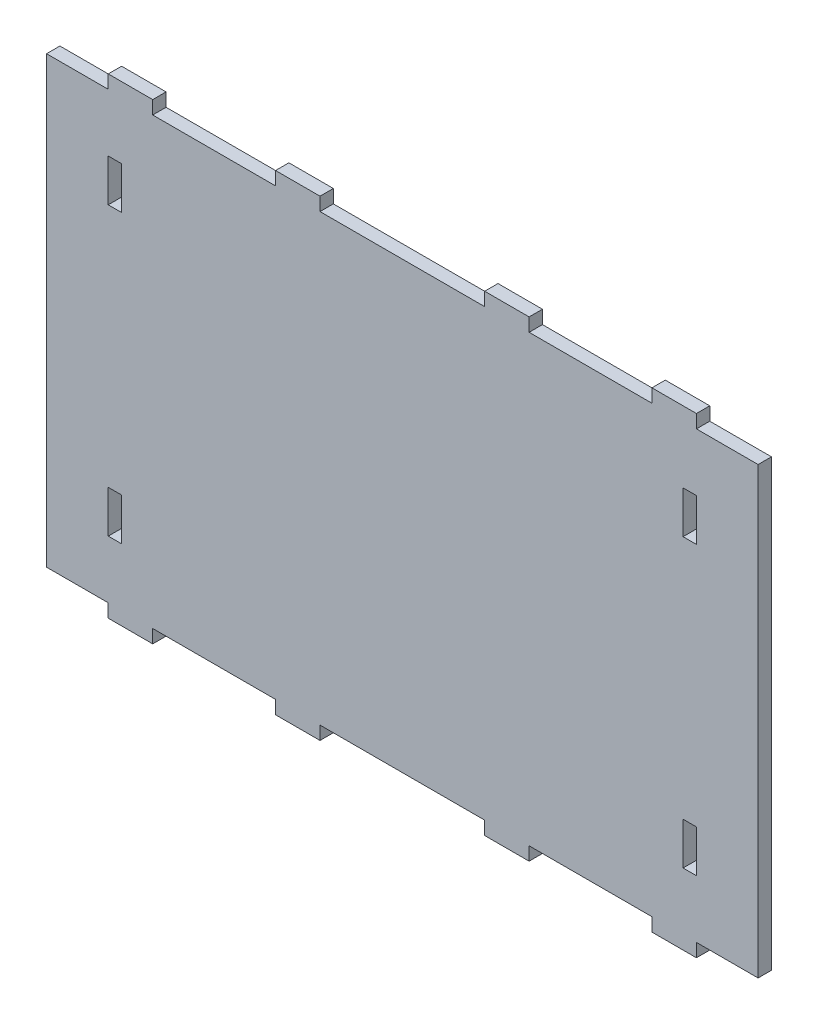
ISO-10303-21;
HEADER;
FILE_DESCRIPTION(('STEP AP214'),'2;1');
FILE_NAME('part.step','',(''),(''),'','','');
FILE_SCHEMA(('AUTOMOTIVE_DESIGN { 1 0 10303 214 1 1 1 1 }'));
ENDSEC;
DATA;
#1=APPLICATION_CONTEXT('core data for automotive mechanical design processes');
#2=APPLICATION_PROTOCOL_DEFINITION('international standard','automotive_design',2000,#1);
#3=PRODUCT_CONTEXT('',#1,'mechanical');
#4=PRODUCT('Part','Part','',(#3));
#5=PRODUCT_RELATED_PRODUCT_CATEGORY('part','',(#4));
#6=PRODUCT_DEFINITION_FORMATION('','',#4);
#7=PRODUCT_DEFINITION_CONTEXT('part definition',#1,'design');
#8=PRODUCT_DEFINITION('design','',#6,#7);
#9=PRODUCT_DEFINITION_SHAPE('','',#8);
#10=(LENGTH_UNIT() NAMED_UNIT(*) SI_UNIT(.MILLI.,.METRE.));
#11=(NAMED_UNIT(*) PLANE_ANGLE_UNIT() SI_UNIT($,.RADIAN.));
#12=(NAMED_UNIT(*) SI_UNIT($,.STERADIAN.) SOLID_ANGLE_UNIT());
#13=UNCERTAINTY_MEASURE_WITH_UNIT(LENGTH_MEASURE(1.E-05),#10,'distance_accuracy_value','');
#14=(GEOMETRIC_REPRESENTATION_CONTEXT(3) GLOBAL_UNCERTAINTY_ASSIGNED_CONTEXT((#13)) GLOBAL_UNIT_ASSIGNED_CONTEXT((#10,
#11,#12)) REPRESENTATION_CONTEXT('',''));
#15=CARTESIAN_POINT('',(0.,0.,0.));
#16=DIRECTION('',(0.,0.,1.));
#17=DIRECTION('',(1.,0.,0.));
#18=AXIS2_PLACEMENT_3D('',#15,#16,#17);
#19=CARTESIAN_POINT('',(-80.,0.,3.));
#20=DIRECTION('',(1.,0.,0.));
#21=DIRECTION('',(0.,1.,0.));
#22=AXIS2_PLACEMENT_3D('',#19,#20,#21);
#23=PLANE('',#22);
#24=DIRECTION('',(0.,-1.,0.));
#25=VECTOR('',#24,1.);
#26=CARTESIAN_POINT('',(-80.,0.,0.));
#27=LINE('',#26,#25);
#28=CARTESIAN_POINT('',(-80.,100.,0.));
#29=VERTEX_POINT('',#28);
#30=CARTESIAN_POINT('',(-80.,0.,0.));
#31=VERTEX_POINT('',#30);
#32=EDGE_CURVE('E487',#29,#31,#27,.T.);
#33=ORIENTED_EDGE('',*,*,#32,.T.);
#34=DIRECTION('',(0.,0.,-1.));
#35=VECTOR('',#34,1.);
#36=CARTESIAN_POINT('',(-80.,0.,3.));
#37=LINE('',#36,#35);
#38=CARTESIAN_POINT('',(-80.,0.,3.));
#39=VERTEX_POINT('',#38);
#40=EDGE_CURVE('E11',#39,#31,#37,.T.);
#41=ORIENTED_EDGE('',*,*,#40,.F.);
#42=DIRECTION('',(0.,-1.,0.));
#43=VECTOR('',#42,1.);
#44=CARTESIAN_POINT('',(-80.,0.,3.));
#45=LINE('',#44,#43);
#46=CARTESIAN_POINT('',(-80.,100.,3.));
#47=VERTEX_POINT('',#46);
#48=EDGE_CURVE('E494',#47,#39,#45,.T.);
#49=ORIENTED_EDGE('',*,*,#48,.F.);
#50=DIRECTION('',(0.,0.,-1.));
#51=VECTOR('',#50,1.);
#52=CARTESIAN_POINT('',(-80.,100.,3.));
#53=LINE('',#52,#51);
#54=EDGE_CURVE('E568',#47,#29,#53,.T.);
#55=ORIENTED_EDGE('',*,*,#54,.T.);
#56=EDGE_LOOP('',(#33,#41,#49,#55));
#57=FACE_BOUND('',#56,.T.);
#58=ADVANCED_FACE('F33',(#57),#23,.F.);
#59=CARTESIAN_POINT('',(-80.,0.,3.));
#60=DIRECTION('',(0.,1.,0.));
#61=DIRECTION('',(0.,0.,1.));
#62=AXIS2_PLACEMENT_3D('',#59,#60,#61);
#63=PLANE('',#62);
#64=DIRECTION('',(1.,0.,0.));
#65=VECTOR('',#64,1.);
#66=CARTESIAN_POINT('',(-80.,0.,0.));
#67=LINE('',#66,#65);
#68=CARTESIAN_POINT('',(-66.1305116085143,0.,0.));
#69=VERTEX_POINT('',#68);
#70=EDGE_CURVE('E571',#31,#69,#67,.T.);
#71=ORIENTED_EDGE('',*,*,#70,.T.);
#72=DIRECTION('',(0.,0.,-1.));
#73=VECTOR('',#72,1.);
#74=CARTESIAN_POINT('',(-66.1305116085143,0.,3.));
#75=LINE('',#74,#73);
#76=CARTESIAN_POINT('',(-66.1305116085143,0.,3.));
#77=VERTEX_POINT('',#76);
#78=EDGE_CURVE('E40',#77,#69,#75,.T.);
#79=ORIENTED_EDGE('',*,*,#78,.F.);
#80=DIRECTION('',(1.,0.,0.));
#81=VECTOR('',#80,1.);
#82=CARTESIAN_POINT('',(-80.,0.,3.));
#83=LINE('',#82,#81);
#84=EDGE_CURVE('E497',#39,#77,#83,.T.);
#85=ORIENTED_EDGE('',*,*,#84,.F.);
#86=ORIENTED_EDGE('',*,*,#40,.T.);
#87=EDGE_LOOP('',(#71,#79,#85,#86));
#88=FACE_BOUND('',#87,.T.);
#89=ADVANCED_FACE('F767',(#88),#63,.F.);
#90=CARTESIAN_POINT('',(-66.1305116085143,0.,3.));
#91=DIRECTION('',(1.,0.,0.));
#92=DIRECTION('',(0.,0.,-1.));
#93=AXIS2_PLACEMENT_3D('',#90,#91,#92);
#94=PLANE('',#93);
#95=DIRECTION('',(0.,-1.,0.));
#96=VECTOR('',#95,1.);
#97=CARTESIAN_POINT('',(-66.1305116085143,0.,0.));
#98=LINE('',#97,#96);
#99=CARTESIAN_POINT('',(-66.1305116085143,-3.,0.));
#100=VERTEX_POINT('',#99);
#101=EDGE_CURVE('E573',#69,#100,#98,.T.);
#102=ORIENTED_EDGE('',*,*,#101,.T.);
#103=DIRECTION('',(0.,0.,-1.));
#104=VECTOR('',#103,1.);
#105=CARTESIAN_POINT('',(-66.1305116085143,-3.,3.));
#106=LINE('',#105,#104);
#107=CARTESIAN_POINT('',(-66.1305116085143,-3.,3.));
#108=VERTEX_POINT('',#107);
#109=EDGE_CURVE('E738',#108,#100,#106,.T.);
#110=ORIENTED_EDGE('',*,*,#109,.F.);
#111=DIRECTION('',(0.,-1.,0.));
#112=VECTOR('',#111,1.);
#113=CARTESIAN_POINT('',(-66.1305116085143,0.,3.));
#114=LINE('',#113,#112);
#115=EDGE_CURVE('E500',#77,#108,#114,.T.);
#116=ORIENTED_EDGE('',*,*,#115,.F.);
#117=ORIENTED_EDGE('',*,*,#78,.T.);
#118=EDGE_LOOP('',(#102,#110,#116,#117));
#119=FACE_BOUND('',#118,.T.);
#120=ADVANCED_FACE('F745',(#119),#94,.F.);
#121=CARTESIAN_POINT('',(-66.1305116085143,-3.,3.));
#122=DIRECTION('',(0.,1.,0.));
#123=DIRECTION('',(0.,0.,1.));
#124=AXIS2_PLACEMENT_3D('',#121,#122,#123);
#125=PLANE('',#124);
#126=DIRECTION('',(1.,0.,0.));
#127=VECTOR('',#126,1.);
#128=CARTESIAN_POINT('',(-66.1305116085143,-3.,0.));
#129=LINE('',#128,#127);
#130=CARTESIAN_POINT('',(-56.1305116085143,-3.,0.));
#131=VERTEX_POINT('',#130);
#132=EDGE_CURVE('E575',#100,#131,#129,.T.);
#133=ORIENTED_EDGE('',*,*,#132,.T.);
#134=DIRECTION('',(0.,0.,-1.));
#135=VECTOR('',#134,1.);
#136=CARTESIAN_POINT('',(-56.1305116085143,-3.,3.));
#137=LINE('',#136,#135);
#138=CARTESIAN_POINT('',(-56.1305116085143,-3.,3.));
#139=VERTEX_POINT('',#138);
#140=EDGE_CURVE('E735',#139,#131,#137,.T.);
#141=ORIENTED_EDGE('',*,*,#140,.F.);
#142=DIRECTION('',(1.,0.,0.));
#143=VECTOR('',#142,1.);
#144=CARTESIAN_POINT('',(-66.1305116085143,-3.,3.));
#145=LINE('',#144,#143);
#146=EDGE_CURVE('E502',#108,#139,#145,.T.);
#147=ORIENTED_EDGE('',*,*,#146,.F.);
#148=ORIENTED_EDGE('',*,*,#109,.T.);
#149=EDGE_LOOP('',(#133,#141,#147,#148));
#150=FACE_BOUND('',#149,.T.);
#151=ADVANCED_FACE('F755',(#150),#125,.F.);
#152=CARTESIAN_POINT('',(-56.1305116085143,-3.,3.));
#153=DIRECTION('',(-1.,0.,0.));
#154=DIRECTION('',(0.,0.,1.));
#155=AXIS2_PLACEMENT_3D('',#152,#153,#154);
#156=PLANE('',#155);
#157=DIRECTION('',(0.,1.,0.));
#158=VECTOR('',#157,1.);
#159=CARTESIAN_POINT('',(-56.1305116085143,-3.,0.));
#160=LINE('',#159,#158);
#161=CARTESIAN_POINT('',(-56.1305116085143,0.,0.));
#162=VERTEX_POINT('',#161);
#163=EDGE_CURVE('E577',#131,#162,#160,.T.);
#164=ORIENTED_EDGE('',*,*,#163,.T.);
#165=DIRECTION('',(0.,0.,-1.));
#166=VECTOR('',#165,1.);
#167=CARTESIAN_POINT('',(-56.1305116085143,0.,3.));
#168=LINE('',#167,#166);
#169=CARTESIAN_POINT('',(-56.1305116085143,0.,3.));
#170=VERTEX_POINT('',#169);
#171=EDGE_CURVE('E732',#170,#162,#168,.T.);
#172=ORIENTED_EDGE('',*,*,#171,.F.);
#173=DIRECTION('',(0.,1.,0.));
#174=VECTOR('',#173,1.);
#175=CARTESIAN_POINT('',(-56.1305116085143,-3.,3.));
#176=LINE('',#175,#174);
#177=EDGE_CURVE('E504',#139,#170,#176,.T.);
#178=ORIENTED_EDGE('',*,*,#177,.F.);
#179=ORIENTED_EDGE('',*,*,#140,.T.);
#180=EDGE_LOOP('',(#164,#172,#178,#179));
#181=FACE_BOUND('',#180,.T.);
#182=ADVANCED_FACE('F759',(#181),#156,.F.);
#183=CARTESIAN_POINT('',(-56.1305116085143,0.,3.));
#184=DIRECTION('',(0.,1.,0.));
#185=DIRECTION('',(0.,0.,1.));
#186=AXIS2_PLACEMENT_3D('',#183,#184,#185);
#187=PLANE('',#186);
#188=DIRECTION('',(1.,0.,0.));
#189=VECTOR('',#188,1.);
#190=CARTESIAN_POINT('',(-56.1305116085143,0.,0.));
#191=LINE('',#190,#189);
#192=CARTESIAN_POINT('',(-28.5111518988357,0.,0.));
#193=VERTEX_POINT('',#192);
#194=EDGE_CURVE('E579',#162,#193,#191,.T.);
#195=ORIENTED_EDGE('',*,*,#194,.T.);
#196=DIRECTION('',(0.,0.,-1.));
#197=VECTOR('',#196,1.);
#198=CARTESIAN_POINT('',(-28.5111518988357,0.,3.));
#199=LINE('',#198,#197);
#200=CARTESIAN_POINT('',(-28.5111518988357,0.,3.));
#201=VERTEX_POINT('',#200);
#202=EDGE_CURVE('E729',#201,#193,#199,.T.);
#203=ORIENTED_EDGE('',*,*,#202,.F.);
#204=DIRECTION('',(1.,0.,0.));
#205=VECTOR('',#204,1.);
#206=CARTESIAN_POINT('',(-56.1305116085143,0.,3.));
#207=LINE('',#206,#205);
#208=EDGE_CURVE('E506',#170,#201,#207,.T.);
#209=ORIENTED_EDGE('',*,*,#208,.F.);
#210=ORIENTED_EDGE('',*,*,#171,.T.);
#211=EDGE_LOOP('',(#195,#203,#209,#210));
#212=FACE_BOUND('',#211,.T.);
#213=ADVANCED_FACE('F920',(#212),#187,.F.);
#214=CARTESIAN_POINT('',(-28.5111518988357,0.,3.));
#215=DIRECTION('',(1.,0.,0.));
#216=DIRECTION('',(0.,0.,-1.));
#217=AXIS2_PLACEMENT_3D('',#214,#215,#216);
#218=PLANE('',#217);
#219=DIRECTION('',(0.,-1.,0.));
#220=VECTOR('',#219,1.);
#221=CARTESIAN_POINT('',(-28.5111518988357,0.,0.));
#222=LINE('',#221,#220);
#223=CARTESIAN_POINT('',(-28.5111518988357,-3.,0.));
#224=VERTEX_POINT('',#223);
#225=EDGE_CURVE('E581',#193,#224,#222,.T.);
#226=ORIENTED_EDGE('',*,*,#225,.T.);
#227=DIRECTION('',(0.,0.,-1.));
#228=VECTOR('',#227,1.);
#229=CARTESIAN_POINT('',(-28.5111518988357,-3.,3.));
#230=LINE('',#229,#228);
#231=CARTESIAN_POINT('',(-28.5111518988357,-3.,3.));
#232=VERTEX_POINT('',#231);
#233=EDGE_CURVE('E726',#232,#224,#230,.T.);
#234=ORIENTED_EDGE('',*,*,#233,.F.);
#235=DIRECTION('',(0.,-1.,0.));
#236=VECTOR('',#235,1.);
#237=CARTESIAN_POINT('',(-28.5111518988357,0.,3.));
#238=LINE('',#237,#236);
#239=EDGE_CURVE('E508',#201,#232,#238,.T.);
#240=ORIENTED_EDGE('',*,*,#239,.F.);
#241=ORIENTED_EDGE('',*,*,#202,.T.);
#242=EDGE_LOOP('',(#226,#234,#240,#241));
#243=FACE_BOUND('',#242,.T.);
#244=ADVANCED_FACE('F918',(#243),#218,.F.);
#245=CARTESIAN_POINT('',(-28.5111518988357,-3.,3.));
#246=DIRECTION('',(0.,1.,0.));
#247=DIRECTION('',(0.,0.,1.));
#248=AXIS2_PLACEMENT_3D('',#245,#246,#247);
#249=PLANE('',#248);
#250=DIRECTION('',(1.,0.,0.));
#251=VECTOR('',#250,1.);
#252=CARTESIAN_POINT('',(-28.5111518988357,-3.,0.));
#253=LINE('',#252,#251);
#254=CARTESIAN_POINT('',(-18.5111518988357,-3.,0.));
#255=VERTEX_POINT('',#254);
#256=EDGE_CURVE('E583',#224,#255,#253,.T.);
#257=ORIENTED_EDGE('',*,*,#256,.T.);
#258=DIRECTION('',(0.,0.,-1.));
#259=VECTOR('',#258,1.);
#260=CARTESIAN_POINT('',(-18.5111518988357,-3.,3.));
#261=LINE('',#260,#259);
#262=CARTESIAN_POINT('',(-18.5111518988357,-3.,3.));
#263=VERTEX_POINT('',#262);
#264=EDGE_CURVE('E723',#263,#255,#261,.T.);
#265=ORIENTED_EDGE('',*,*,#264,.F.);
#266=DIRECTION('',(1.,0.,0.));
#267=VECTOR('',#266,1.);
#268=CARTESIAN_POINT('',(-28.5111518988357,-3.,3.));
#269=LINE('',#268,#267);
#270=EDGE_CURVE('E510',#232,#263,#269,.T.);
#271=ORIENTED_EDGE('',*,*,#270,.F.);
#272=ORIENTED_EDGE('',*,*,#233,.T.);
#273=EDGE_LOOP('',(#257,#265,#271,#272));
#274=FACE_BOUND('',#273,.T.);
#275=ADVANCED_FACE('F914',(#274),#249,.F.);
#276=CARTESIAN_POINT('',(-18.5111518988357,-3.,3.));
#277=DIRECTION('',(-1.,0.,0.));
#278=DIRECTION('',(0.,0.,1.));
#279=AXIS2_PLACEMENT_3D('',#276,#277,#278);
#280=PLANE('',#279);
#281=DIRECTION('',(0.,1.,0.));
#282=VECTOR('',#281,1.);
#283=CARTESIAN_POINT('',(-18.5111518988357,-3.,0.));
#284=LINE('',#283,#282);
#285=CARTESIAN_POINT('',(-18.5111518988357,0.,0.));
#286=VERTEX_POINT('',#285);
#287=EDGE_CURVE('E585',#255,#286,#284,.T.);
#288=ORIENTED_EDGE('',*,*,#287,.T.);
#289=DIRECTION('',(0.,0.,-1.));
#290=VECTOR('',#289,1.);
#291=CARTESIAN_POINT('',(-18.5111518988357,0.,3.));
#292=LINE('',#291,#290);
#293=CARTESIAN_POINT('',(-18.5111518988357,0.,3.));
#294=VERTEX_POINT('',#293);
#295=EDGE_CURVE('E720',#294,#286,#292,.T.);
#296=ORIENTED_EDGE('',*,*,#295,.F.);
#297=DIRECTION('',(0.,1.,0.));
#298=VECTOR('',#297,1.);
#299=CARTESIAN_POINT('',(-18.5111518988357,-3.,3.));
#300=LINE('',#299,#298);
#301=EDGE_CURVE('E512',#263,#294,#300,.T.);
#302=ORIENTED_EDGE('',*,*,#301,.F.);
#303=ORIENTED_EDGE('',*,*,#264,.T.);
#304=EDGE_LOOP('',(#288,#296,#302,#303));
#305=FACE_BOUND('',#304,.T.);
#306=ADVANCED_FACE('F909',(#305),#280,.F.);
#307=CARTESIAN_POINT('',(-18.5111518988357,0.,3.));
#308=DIRECTION('',(0.,1.,0.));
#309=DIRECTION('',(0.,0.,1.));
#310=AXIS2_PLACEMENT_3D('',#307,#308,#309);
#311=PLANE('',#310);
#312=DIRECTION('',(1.,0.,0.));
#313=VECTOR('',#312,1.);
#314=CARTESIAN_POINT('',(-18.5111518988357,0.,0.));
#315=LINE('',#314,#313);
#316=CARTESIAN_POINT('',(18.5111518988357,0.,0.));
#317=VERTEX_POINT('',#316);
#318=EDGE_CURVE('E587',#286,#317,#315,.T.);
#319=ORIENTED_EDGE('',*,*,#318,.T.);
#320=DIRECTION('',(0.,0.,-1.));
#321=VECTOR('',#320,1.);
#322=CARTESIAN_POINT('',(18.5111518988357,0.,3.));
#323=LINE('',#322,#321);
#324=CARTESIAN_POINT('',(18.5111518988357,0.,3.));
#325=VERTEX_POINT('',#324);
#326=EDGE_CURVE('E717',#325,#317,#323,.T.);
#327=ORIENTED_EDGE('',*,*,#326,.F.);
#328=DIRECTION('',(1.,0.,0.));
#329=VECTOR('',#328,1.);
#330=CARTESIAN_POINT('',(-18.5111518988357,0.,3.));
#331=LINE('',#330,#329);
#332=EDGE_CURVE('E514',#294,#325,#331,.T.);
#333=ORIENTED_EDGE('',*,*,#332,.F.);
#334=ORIENTED_EDGE('',*,*,#295,.T.);
#335=EDGE_LOOP('',(#319,#327,#333,#334));
#336=FACE_BOUND('',#335,.T.);
#337=ADVANCED_FACE('F903',(#336),#311,.F.);
#338=CARTESIAN_POINT('',(18.5111518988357,-3.,3.));
#339=DIRECTION('',(1.,0.,0.));
#340=DIRECTION('',(0.,0.,-1.));
#341=AXIS2_PLACEMENT_3D('',#338,#339,#340);
#342=PLANE('',#341);
#343=DIRECTION('',(0.,-1.,0.));
#344=VECTOR('',#343,1.);
#345=CARTESIAN_POINT('',(18.5111518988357,-3.,0.));
#346=LINE('',#345,#344);
#347=CARTESIAN_POINT('',(18.5111518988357,-3.,0.));
#348=VERTEX_POINT('',#347);
#349=EDGE_CURVE('E589',#317,#348,#346,.T.);
#350=ORIENTED_EDGE('',*,*,#349,.T.);
#351=DIRECTION('',(0.,0.,-1.));
#352=VECTOR('',#351,1.);
#353=CARTESIAN_POINT('',(18.5111518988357,-3.,3.));
#354=LINE('',#353,#352);
#355=CARTESIAN_POINT('',(18.5111518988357,-3.,3.));
#356=VERTEX_POINT('',#355);
#357=EDGE_CURVE('E714',#356,#348,#354,.T.);
#358=ORIENTED_EDGE('',*,*,#357,.F.);
#359=DIRECTION('',(0.,-1.,0.));
#360=VECTOR('',#359,1.);
#361=CARTESIAN_POINT('',(18.5111518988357,-3.,3.));
#362=LINE('',#361,#360);
#363=EDGE_CURVE('E516',#325,#356,#362,.T.);
#364=ORIENTED_EDGE('',*,*,#363,.F.);
#365=ORIENTED_EDGE('',*,*,#326,.T.);
#366=EDGE_LOOP('',(#350,#358,#364,#365));
#367=FACE_BOUND('',#366,.T.);
#368=ADVANCED_FACE('F899',(#367),#342,.F.);
#369=CARTESIAN_POINT('',(28.5111518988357,-3.,3.));
#370=DIRECTION('',(0.,1.,0.));
#371=DIRECTION('',(0.,0.,1.));
#372=AXIS2_PLACEMENT_3D('',#369,#370,#371);
#373=PLANE('',#372);
#374=DIRECTION('',(1.,0.,0.));
#375=VECTOR('',#374,1.);
#376=CARTESIAN_POINT('',(28.5111518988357,-3.,0.));
#377=LINE('',#376,#375);
#378=CARTESIAN_POINT('',(28.5111518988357,-3.,0.));
#379=VERTEX_POINT('',#378);
#380=EDGE_CURVE('E591',#348,#379,#377,.T.);
#381=ORIENTED_EDGE('',*,*,#380,.T.);
#382=DIRECTION('',(0.,0.,-1.));
#383=VECTOR('',#382,1.);
#384=CARTESIAN_POINT('',(28.5111518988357,-3.,3.));
#385=LINE('',#384,#383);
#386=CARTESIAN_POINT('',(28.5111518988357,-3.,3.));
#387=VERTEX_POINT('',#386);
#388=EDGE_CURVE('E711',#387,#379,#385,.T.);
#389=ORIENTED_EDGE('',*,*,#388,.F.);
#390=DIRECTION('',(1.,0.,0.));
#391=VECTOR('',#390,1.);
#392=CARTESIAN_POINT('',(28.5111518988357,-3.,3.));
#393=LINE('',#392,#391);
#394=EDGE_CURVE('E518',#356,#387,#393,.T.);
#395=ORIENTED_EDGE('',*,*,#394,.F.);
#396=ORIENTED_EDGE('',*,*,#357,.T.);
#397=EDGE_LOOP('',(#381,#389,#395,#396));
#398=FACE_BOUND('',#397,.T.);
#399=ADVANCED_FACE('F894',(#398),#373,.F.);
#400=CARTESIAN_POINT('',(28.5111518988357,0.,3.));
#401=DIRECTION('',(-1.,0.,0.));
#402=DIRECTION('',(0.,0.,1.));
#403=AXIS2_PLACEMENT_3D('',#400,#401,#402);
#404=PLANE('',#403);
#405=DIRECTION('',(0.,1.,0.));
#406=VECTOR('',#405,1.);
#407=CARTESIAN_POINT('',(28.5111518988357,0.,0.));
#408=LINE('',#407,#406);
#409=CARTESIAN_POINT('',(28.5111518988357,0.,0.));
#410=VERTEX_POINT('',#409);
#411=EDGE_CURVE('E593',#379,#410,#408,.T.);
#412=ORIENTED_EDGE('',*,*,#411,.T.);
#413=DIRECTION('',(0.,0.,-1.));
#414=VECTOR('',#413,1.);
#415=CARTESIAN_POINT('',(28.5111518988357,0.,3.));
#416=LINE('',#415,#414);
#417=CARTESIAN_POINT('',(28.5111518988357,0.,3.));
#418=VERTEX_POINT('',#417);
#419=EDGE_CURVE('E708',#418,#410,#416,.T.);
#420=ORIENTED_EDGE('',*,*,#419,.F.);
#421=DIRECTION('',(0.,1.,0.));
#422=VECTOR('',#421,1.);
#423=CARTESIAN_POINT('',(28.5111518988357,0.,3.));
#424=LINE('',#423,#422);
#425=EDGE_CURVE('E520',#387,#418,#424,.T.);
#426=ORIENTED_EDGE('',*,*,#425,.F.);
#427=ORIENTED_EDGE('',*,*,#388,.T.);
#428=EDGE_LOOP('',(#412,#420,#426,#427));
#429=FACE_BOUND('',#428,.T.);
#430=ADVANCED_FACE('F888',(#429),#404,.F.);
#431=CARTESIAN_POINT('',(56.1305116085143,0.,3.));
#432=DIRECTION('',(0.,1.,0.));
#433=DIRECTION('',(0.,0.,1.));
#434=AXIS2_PLACEMENT_3D('',#431,#432,#433);
#435=PLANE('',#434);
#436=DIRECTION('',(1.,0.,0.));
#437=VECTOR('',#436,1.);
#438=CARTESIAN_POINT('',(56.1305116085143,0.,0.));
#439=LINE('',#438,#437);
#440=CARTESIAN_POINT('',(56.1305116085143,0.,0.));
#441=VERTEX_POINT('',#440);
#442=EDGE_CURVE('E595',#410,#441,#439,.T.);
#443=ORIENTED_EDGE('',*,*,#442,.T.);
#444=DIRECTION('',(0.,0.,-1.));
#445=VECTOR('',#444,1.);
#446=CARTESIAN_POINT('',(56.1305116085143,0.,3.));
#447=LINE('',#446,#445);
#448=CARTESIAN_POINT('',(56.1305116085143,0.,3.));
#449=VERTEX_POINT('',#448);
#450=EDGE_CURVE('E705',#449,#441,#447,.T.);
#451=ORIENTED_EDGE('',*,*,#450,.F.);
#452=DIRECTION('',(1.,0.,0.));
#453=VECTOR('',#452,1.);
#454=CARTESIAN_POINT('',(56.1305116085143,0.,3.));
#455=LINE('',#454,#453);
#456=EDGE_CURVE('E522',#418,#449,#455,.T.);
#457=ORIENTED_EDGE('',*,*,#456,.F.);
#458=ORIENTED_EDGE('',*,*,#419,.T.);
#459=EDGE_LOOP('',(#443,#451,#457,#458));
#460=FACE_BOUND('',#459,.T.);
#461=ADVANCED_FACE('F884',(#460),#435,.F.);
#462=CARTESIAN_POINT('',(56.1305116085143,-3.,3.));
#463=DIRECTION('',(1.,0.,0.));
#464=DIRECTION('',(0.,0.,-1.));
#465=AXIS2_PLACEMENT_3D('',#462,#463,#464);
#466=PLANE('',#465);
#467=DIRECTION('',(0.,-1.,0.));
#468=VECTOR('',#467,1.);
#469=CARTESIAN_POINT('',(56.1305116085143,-3.,0.));
#470=LINE('',#469,#468);
#471=CARTESIAN_POINT('',(56.1305116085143,-3.,0.));
#472=VERTEX_POINT('',#471);
#473=EDGE_CURVE('E597',#441,#472,#470,.T.);
#474=ORIENTED_EDGE('',*,*,#473,.T.);
#475=DIRECTION('',(0.,0.,-1.));
#476=VECTOR('',#475,1.);
#477=CARTESIAN_POINT('',(56.1305116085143,-3.,3.));
#478=LINE('',#477,#476);
#479=CARTESIAN_POINT('',(56.1305116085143,-3.,3.));
#480=VERTEX_POINT('',#479);
#481=EDGE_CURVE('E702',#480,#472,#478,.T.);
#482=ORIENTED_EDGE('',*,*,#481,.F.);
#483=DIRECTION('',(0.,-1.,0.));
#484=VECTOR('',#483,1.);
#485=CARTESIAN_POINT('',(56.1305116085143,-3.,3.));
#486=LINE('',#485,#484);
#487=EDGE_CURVE('E524',#449,#480,#486,.T.);
#488=ORIENTED_EDGE('',*,*,#487,.F.);
#489=ORIENTED_EDGE('',*,*,#450,.T.);
#490=EDGE_LOOP('',(#474,#482,#488,#489));
#491=FACE_BOUND('',#490,.T.);
#492=ADVANCED_FACE('F879',(#491),#466,.F.);
#493=CARTESIAN_POINT('',(66.1305116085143,-3.,3.));
#494=DIRECTION('',(0.,1.,0.));
#495=DIRECTION('',(0.,0.,1.));
#496=AXIS2_PLACEMENT_3D('',#493,#494,#495);
#497=PLANE('',#496);
#498=DIRECTION('',(1.,0.,0.));
#499=VECTOR('',#498,1.);
#500=CARTESIAN_POINT('',(66.1305116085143,-3.,0.));
#501=LINE('',#500,#499);
#502=CARTESIAN_POINT('',(66.1305116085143,-3.,0.));
#503=VERTEX_POINT('',#502);
#504=EDGE_CURVE('E599',#472,#503,#501,.T.);
#505=ORIENTED_EDGE('',*,*,#504,.T.);
#506=DIRECTION('',(0.,0.,-1.));
#507=VECTOR('',#506,1.);
#508=CARTESIAN_POINT('',(66.1305116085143,-3.,3.));
#509=LINE('',#508,#507);
#510=CARTESIAN_POINT('',(66.1305116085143,-3.,3.));
#511=VERTEX_POINT('',#510);
#512=EDGE_CURVE('E699',#511,#503,#509,.T.);
#513=ORIENTED_EDGE('',*,*,#512,.F.);
#514=DIRECTION('',(1.,0.,0.));
#515=VECTOR('',#514,1.);
#516=CARTESIAN_POINT('',(66.1305116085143,-3.,3.));
#517=LINE('',#516,#515);
#518=EDGE_CURVE('E526',#480,#511,#517,.T.);
#519=ORIENTED_EDGE('',*,*,#518,.F.);
#520=ORIENTED_EDGE('',*,*,#481,.T.);
#521=EDGE_LOOP('',(#505,#513,#519,#520));
#522=FACE_BOUND('',#521,.T.);
#523=ADVANCED_FACE('F873',(#522),#497,.F.);
#524=CARTESIAN_POINT('',(66.1305116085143,0.,3.));
#525=DIRECTION('',(-1.,0.,0.));
#526=DIRECTION('',(0.,0.,1.));
#527=AXIS2_PLACEMENT_3D('',#524,#525,#526);
#528=PLANE('',#527);
#529=DIRECTION('',(0.,1.,0.));
#530=VECTOR('',#529,1.);
#531=CARTESIAN_POINT('',(66.1305116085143,0.,0.));
#532=LINE('',#531,#530);
#533=CARTESIAN_POINT('',(66.1305116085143,0.,0.));
#534=VERTEX_POINT('',#533);
#535=EDGE_CURVE('E601',#503,#534,#532,.T.);
#536=ORIENTED_EDGE('',*,*,#535,.T.);
#537=DIRECTION('',(0.,0.,-1.));
#538=VECTOR('',#537,1.);
#539=CARTESIAN_POINT('',(66.1305116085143,0.,3.));
#540=LINE('',#539,#538);
#541=CARTESIAN_POINT('',(66.1305116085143,0.,3.));
#542=VERTEX_POINT('',#541);
#543=EDGE_CURVE('E696',#542,#534,#540,.T.);
#544=ORIENTED_EDGE('',*,*,#543,.F.);
#545=DIRECTION('',(0.,1.,0.));
#546=VECTOR('',#545,1.);
#547=CARTESIAN_POINT('',(66.1305116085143,0.,3.));
#548=LINE('',#547,#546);
#549=EDGE_CURVE('E528',#511,#542,#548,.T.);
#550=ORIENTED_EDGE('',*,*,#549,.F.);
#551=ORIENTED_EDGE('',*,*,#512,.T.);
#552=EDGE_LOOP('',(#536,#544,#550,#551));
#553=FACE_BOUND('',#552,.T.);
#554=ADVANCED_FACE('F869',(#553),#528,.F.);
#555=CARTESIAN_POINT('',(80.,0.,3.));
#556=DIRECTION('',(0.,1.,0.));
#557=DIRECTION('',(0.,0.,1.));
#558=AXIS2_PLACEMENT_3D('',#555,#556,#557);
#559=PLANE('',#558);
#560=DIRECTION('',(1.,0.,0.));
#561=VECTOR('',#560,1.);
#562=CARTESIAN_POINT('',(80.,0.,0.));
#563=LINE('',#562,#561);
#564=CARTESIAN_POINT('',(80.,0.,0.));
#565=VERTEX_POINT('',#564);
#566=EDGE_CURVE('E603',#534,#565,#563,.T.);
#567=ORIENTED_EDGE('',*,*,#566,.T.);
#568=DIRECTION('',(0.,0.,-1.));
#569=VECTOR('',#568,1.);
#570=CARTESIAN_POINT('',(80.,0.,3.));
#571=LINE('',#570,#569);
#572=CARTESIAN_POINT('',(80.,0.,3.));
#573=VERTEX_POINT('',#572);
#574=EDGE_CURVE('E693',#573,#565,#571,.T.);
#575=ORIENTED_EDGE('',*,*,#574,.F.);
#576=DIRECTION('',(1.,0.,0.));
#577=VECTOR('',#576,1.);
#578=CARTESIAN_POINT('',(80.,0.,3.));
#579=LINE('',#578,#577);
#580=EDGE_CURVE('E530',#542,#573,#579,.T.);
#581=ORIENTED_EDGE('',*,*,#580,.F.);
#582=ORIENTED_EDGE('',*,*,#543,.T.);
#583=EDGE_LOOP('',(#567,#575,#581,#582));
#584=FACE_BOUND('',#583,.T.);
#585=ADVANCED_FACE('F864',(#584),#559,.F.);
#586=CARTESIAN_POINT('',(80.,100.,3.));
#587=DIRECTION('',(-1.,0.,0.));
#588=DIRECTION('',(0.,0.,1.));
#589=AXIS2_PLACEMENT_3D('',#586,#587,#588);
#590=PLANE('',#589);
#591=DIRECTION('',(0.,1.,0.));
#592=VECTOR('',#591,1.);
#593=CARTESIAN_POINT('',(80.,100.,0.));
#594=LINE('',#593,#592);
#595=CARTESIAN_POINT('',(80.,100.,0.));
#596=VERTEX_POINT('',#595);
#597=EDGE_CURVE('E605',#565,#596,#594,.T.);
#598=ORIENTED_EDGE('',*,*,#597,.T.);
#599=DIRECTION('',(0.,0.,-1.));
#600=VECTOR('',#599,1.);
#601=CARTESIAN_POINT('',(80.,100.,3.));
#602=LINE('',#601,#600);
#603=CARTESIAN_POINT('',(80.,100.,3.));
#604=VERTEX_POINT('',#603);
#605=EDGE_CURVE('E690',#604,#596,#602,.T.);
#606=ORIENTED_EDGE('',*,*,#605,.F.);
#607=DIRECTION('',(0.,1.,0.));
#608=VECTOR('',#607,1.);
#609=CARTESIAN_POINT('',(80.,100.,3.));
#610=LINE('',#609,#608);
#611=EDGE_CURVE('E532',#573,#604,#610,.T.);
#612=ORIENTED_EDGE('',*,*,#611,.F.);
#613=ORIENTED_EDGE('',*,*,#574,.T.);
#614=EDGE_LOOP('',(#598,#606,#612,#613));
#615=FACE_BOUND('',#614,.T.);
#616=ADVANCED_FACE('F858',(#615),#590,.F.);
#617=CARTESIAN_POINT('',(80.,100.,3.));
#618=DIRECTION('',(0.,-1.,0.));
#619=DIRECTION('',(1.,0.,0.));
#620=AXIS2_PLACEMENT_3D('',#617,#618,#619);
#621=PLANE('',#620);
#622=DIRECTION('',(-1.,0.,0.));
#623=VECTOR('',#622,1.);
#624=CARTESIAN_POINT('',(80.,100.,0.));
#625=LINE('',#624,#623);
#626=CARTESIAN_POINT('',(66.1305116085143,100.,0.));
#627=VERTEX_POINT('',#626);
#628=EDGE_CURVE('E607',#596,#627,#625,.T.);
#629=ORIENTED_EDGE('',*,*,#628,.T.);
#630=DIRECTION('',(0.,0.,-1.));
#631=VECTOR('',#630,1.);
#632=CARTESIAN_POINT('',(66.1305116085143,100.,3.));
#633=LINE('',#632,#631);
#634=CARTESIAN_POINT('',(66.1305116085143,100.,3.));
#635=VERTEX_POINT('',#634);
#636=EDGE_CURVE('E687',#635,#627,#633,.T.);
#637=ORIENTED_EDGE('',*,*,#636,.F.);
#638=DIRECTION('',(-1.,0.,0.));
#639=VECTOR('',#638,1.);
#640=CARTESIAN_POINT('',(80.,100.,3.));
#641=LINE('',#640,#639);
#642=EDGE_CURVE('E534',#604,#635,#641,.T.);
#643=ORIENTED_EDGE('',*,*,#642,.F.);
#644=ORIENTED_EDGE('',*,*,#605,.T.);
#645=EDGE_LOOP('',(#629,#637,#643,#644));
#646=FACE_BOUND('',#645,.T.);
#647=ADVANCED_FACE('F854',(#646),#621,.F.);
#648=CARTESIAN_POINT('',(66.1305116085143,100.,3.));
#649=DIRECTION('',(-1.,0.,0.));
#650=DIRECTION('',(0.,0.,1.));
#651=AXIS2_PLACEMENT_3D('',#648,#649,#650);
#652=PLANE('',#651);
#653=DIRECTION('',(0.,1.,0.));
#654=VECTOR('',#653,1.);
#655=CARTESIAN_POINT('',(66.1305116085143,100.,0.));
#656=LINE('',#655,#654);
#657=CARTESIAN_POINT('',(66.1305116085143,103.,0.));
#658=VERTEX_POINT('',#657);
#659=EDGE_CURVE('E609',#627,#658,#656,.T.);
#660=ORIENTED_EDGE('',*,*,#659,.T.);
#661=DIRECTION('',(0.,0.,-1.));
#662=VECTOR('',#661,1.);
#663=CARTESIAN_POINT('',(66.1305116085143,103.,3.));
#664=LINE('',#663,#662);
#665=CARTESIAN_POINT('',(66.1305116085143,103.,3.));
#666=VERTEX_POINT('',#665);
#667=EDGE_CURVE('E684',#666,#658,#664,.T.);
#668=ORIENTED_EDGE('',*,*,#667,.F.);
#669=DIRECTION('',(0.,1.,0.));
#670=VECTOR('',#669,1.);
#671=CARTESIAN_POINT('',(66.1305116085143,100.,3.));
#672=LINE('',#671,#670);
#673=EDGE_CURVE('E536',#635,#666,#672,.T.);
#674=ORIENTED_EDGE('',*,*,#673,.F.);
#675=ORIENTED_EDGE('',*,*,#636,.T.);
#676=EDGE_LOOP('',(#660,#668,#674,#675));
#677=FACE_BOUND('',#676,.T.);
#678=ADVANCED_FACE('F849',(#677),#652,.F.);
#679=CARTESIAN_POINT('',(66.1305116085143,103.,3.));
#680=DIRECTION('',(0.,-1.,0.));
#681=DIRECTION('',(1.,0.,0.));
#682=AXIS2_PLACEMENT_3D('',#679,#680,#681);
#683=PLANE('',#682);
#684=DIRECTION('',(-1.,0.,0.));
#685=VECTOR('',#684,1.);
#686=CARTESIAN_POINT('',(66.1305116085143,103.,0.));
#687=LINE('',#686,#685);
#688=CARTESIAN_POINT('',(56.1305116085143,103.,0.));
#689=VERTEX_POINT('',#688);
#690=EDGE_CURVE('E611',#658,#689,#687,.T.);
#691=ORIENTED_EDGE('',*,*,#690,.T.);
#692=DIRECTION('',(0.,0.,-1.));
#693=VECTOR('',#692,1.);
#694=CARTESIAN_POINT('',(56.1305116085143,103.,3.));
#695=LINE('',#694,#693);
#696=CARTESIAN_POINT('',(56.1305116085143,103.,3.));
#697=VERTEX_POINT('',#696);
#698=EDGE_CURVE('E681',#697,#689,#695,.T.);
#699=ORIENTED_EDGE('',*,*,#698,.F.);
#700=DIRECTION('',(-1.,0.,0.));
#701=VECTOR('',#700,1.);
#702=CARTESIAN_POINT('',(66.1305116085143,103.,3.));
#703=LINE('',#702,#701);
#704=EDGE_CURVE('E538',#666,#697,#703,.T.);
#705=ORIENTED_EDGE('',*,*,#704,.F.);
#706=ORIENTED_EDGE('',*,*,#667,.T.);
#707=EDGE_LOOP('',(#691,#699,#705,#706));
#708=FACE_BOUND('',#707,.T.);
#709=ADVANCED_FACE('F843',(#708),#683,.F.);
#710=CARTESIAN_POINT('',(56.1305116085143,103.,3.));
#711=DIRECTION('',(1.,0.,0.));
#712=DIRECTION('',(0.,1.,0.));
#713=AXIS2_PLACEMENT_3D('',#710,#711,#712);
#714=PLANE('',#713);
#715=DIRECTION('',(0.,-1.,0.));
#716=VECTOR('',#715,1.);
#717=CARTESIAN_POINT('',(56.1305116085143,103.,0.));
#718=LINE('',#717,#716);
#719=CARTESIAN_POINT('',(56.1305116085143,100.,0.));
#720=VERTEX_POINT('',#719);
#721=EDGE_CURVE('E613',#689,#720,#718,.T.);
#722=ORIENTED_EDGE('',*,*,#721,.T.);
#723=DIRECTION('',(0.,0.,-1.));
#724=VECTOR('',#723,1.);
#725=CARTESIAN_POINT('',(56.1305116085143,100.,3.));
#726=LINE('',#725,#724);
#727=CARTESIAN_POINT('',(56.1305116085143,100.,3.));
#728=VERTEX_POINT('',#727);
#729=EDGE_CURVE('E678',#728,#720,#726,.T.);
#730=ORIENTED_EDGE('',*,*,#729,.F.);
#731=DIRECTION('',(0.,-1.,0.));
#732=VECTOR('',#731,1.);
#733=CARTESIAN_POINT('',(56.1305116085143,103.,3.));
#734=LINE('',#733,#732);
#735=EDGE_CURVE('E540',#697,#728,#734,.T.);
#736=ORIENTED_EDGE('',*,*,#735,.F.);
#737=ORIENTED_EDGE('',*,*,#698,.T.);
#738=EDGE_LOOP('',(#722,#730,#736,#737));
#739=FACE_BOUND('',#738,.T.);
#740=ADVANCED_FACE('F839',(#739),#714,.F.);
#741=CARTESIAN_POINT('',(56.1305116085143,100.,3.));
#742=DIRECTION('',(0.,-1.,0.));
#743=DIRECTION('',(1.,0.,0.));
#744=AXIS2_PLACEMENT_3D('',#741,#742,#743);
#745=PLANE('',#744);
#746=DIRECTION('',(-1.,0.,0.));
#747=VECTOR('',#746,1.);
#748=CARTESIAN_POINT('',(56.1305116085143,100.,0.));
#749=LINE('',#748,#747);
#750=CARTESIAN_POINT('',(28.5111518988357,100.,0.));
#751=VERTEX_POINT('',#750);
#752=EDGE_CURVE('E615',#720,#751,#749,.T.);
#753=ORIENTED_EDGE('',*,*,#752,.T.);
#754=DIRECTION('',(0.,0.,-1.));
#755=VECTOR('',#754,1.);
#756=CARTESIAN_POINT('',(28.5111518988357,100.,3.));
#757=LINE('',#756,#755);
#758=CARTESIAN_POINT('',(28.5111518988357,100.,3.));
#759=VERTEX_POINT('',#758);
#760=EDGE_CURVE('E675',#759,#751,#757,.T.);
#761=ORIENTED_EDGE('',*,*,#760,.F.);
#762=DIRECTION('',(-1.,0.,0.));
#763=VECTOR('',#762,1.);
#764=CARTESIAN_POINT('',(56.1305116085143,100.,3.));
#765=LINE('',#764,#763);
#766=EDGE_CURVE('E542',#728,#759,#765,.T.);
#767=ORIENTED_EDGE('',*,*,#766,.F.);
#768=ORIENTED_EDGE('',*,*,#729,.T.);
#769=EDGE_LOOP('',(#753,#761,#767,#768));
#770=FACE_BOUND('',#769,.T.);
#771=ADVANCED_FACE('F834',(#770),#745,.F.);
#772=CARTESIAN_POINT('',(28.5111518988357,100.,3.));
#773=DIRECTION('',(-1.,0.,0.));
#774=DIRECTION('',(0.,0.,1.));
#775=AXIS2_PLACEMENT_3D('',#772,#773,#774);
#776=PLANE('',#775);
#777=DIRECTION('',(0.,1.,0.));
#778=VECTOR('',#777,1.);
#779=CARTESIAN_POINT('',(28.5111518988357,100.,0.));
#780=LINE('',#779,#778);
#781=CARTESIAN_POINT('',(28.5111518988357,103.,0.));
#782=VERTEX_POINT('',#781);
#783=EDGE_CURVE('E617',#751,#782,#780,.T.);
#784=ORIENTED_EDGE('',*,*,#783,.T.);
#785=DIRECTION('',(0.,0.,-1.));
#786=VECTOR('',#785,1.);
#787=CARTESIAN_POINT('',(28.5111518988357,103.,3.));
#788=LINE('',#787,#786);
#789=CARTESIAN_POINT('',(28.5111518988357,103.,3.));
#790=VERTEX_POINT('',#789);
#791=EDGE_CURVE('E672',#790,#782,#788,.T.);
#792=ORIENTED_EDGE('',*,*,#791,.F.);
#793=DIRECTION('',(0.,1.,0.));
#794=VECTOR('',#793,1.);
#795=CARTESIAN_POINT('',(28.5111518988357,100.,3.));
#796=LINE('',#795,#794);
#797=EDGE_CURVE('E544',#759,#790,#796,.T.);
#798=ORIENTED_EDGE('',*,*,#797,.F.);
#799=ORIENTED_EDGE('',*,*,#760,.T.);
#800=EDGE_LOOP('',(#784,#792,#798,#799));
#801=FACE_BOUND('',#800,.T.);
#802=ADVANCED_FACE('F828',(#801),#776,.F.);
#803=CARTESIAN_POINT('',(28.5111518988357,103.,3.));
#804=DIRECTION('',(0.,-1.,0.));
#805=DIRECTION('',(0.,0.,-1.));
#806=AXIS2_PLACEMENT_3D('',#803,#804,#805);
#807=PLANE('',#806);
#808=DIRECTION('',(-1.,0.,0.));
#809=VECTOR('',#808,1.);
#810=CARTESIAN_POINT('',(28.5111518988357,103.,0.));
#811=LINE('',#810,#809);
#812=CARTESIAN_POINT('',(18.5111518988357,103.,0.));
#813=VERTEX_POINT('',#812);
#814=EDGE_CURVE('E619',#782,#813,#811,.T.);
#815=ORIENTED_EDGE('',*,*,#814,.T.);
#816=DIRECTION('',(0.,0.,-1.));
#817=VECTOR('',#816,1.);
#818=CARTESIAN_POINT('',(18.5111518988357,103.,3.));
#819=LINE('',#818,#817);
#820=CARTESIAN_POINT('',(18.5111518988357,103.,3.));
#821=VERTEX_POINT('',#820);
#822=EDGE_CURVE('E669',#821,#813,#819,.T.);
#823=ORIENTED_EDGE('',*,*,#822,.F.);
#824=DIRECTION('',(-1.,0.,0.));
#825=VECTOR('',#824,1.);
#826=CARTESIAN_POINT('',(28.5111518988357,103.,3.));
#827=LINE('',#826,#825);
#828=EDGE_CURVE('E546',#790,#821,#827,.T.);
#829=ORIENTED_EDGE('',*,*,#828,.F.);
#830=ORIENTED_EDGE('',*,*,#791,.T.);
#831=EDGE_LOOP('',(#815,#823,#829,#830));
#832=FACE_BOUND('',#831,.T.);
#833=ADVANCED_FACE('F824',(#832),#807,.F.);
#834=CARTESIAN_POINT('',(18.5111518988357,103.,3.));
#835=DIRECTION('',(1.,0.,0.));
#836=DIRECTION('',(0.,0.,-1.));
#837=AXIS2_PLACEMENT_3D('',#834,#835,#836);
#838=PLANE('',#837);
#839=DIRECTION('',(0.,-1.,0.));
#840=VECTOR('',#839,1.);
#841=CARTESIAN_POINT('',(18.5111518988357,103.,0.));
#842=LINE('',#841,#840);
#843=CARTESIAN_POINT('',(18.5111518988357,100.,0.));
#844=VERTEX_POINT('',#843);
#845=EDGE_CURVE('E621',#813,#844,#842,.T.);
#846=ORIENTED_EDGE('',*,*,#845,.T.);
#847=DIRECTION('',(0.,0.,-1.));
#848=VECTOR('',#847,1.);
#849=CARTESIAN_POINT('',(18.5111518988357,100.,3.));
#850=LINE('',#849,#848);
#851=CARTESIAN_POINT('',(18.5111518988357,100.,3.));
#852=VERTEX_POINT('',#851);
#853=EDGE_CURVE('E666',#852,#844,#850,.T.);
#854=ORIENTED_EDGE('',*,*,#853,.F.);
#855=DIRECTION('',(0.,-1.,0.));
#856=VECTOR('',#855,1.);
#857=CARTESIAN_POINT('',(18.5111518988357,103.,3.));
#858=LINE('',#857,#856);
#859=EDGE_CURVE('E548',#821,#852,#858,.T.);
#860=ORIENTED_EDGE('',*,*,#859,.F.);
#861=ORIENTED_EDGE('',*,*,#822,.T.);
#862=EDGE_LOOP('',(#846,#854,#860,#861));
#863=FACE_BOUND('',#862,.T.);
#864=ADVANCED_FACE('F819',(#863),#838,.F.);
#865=CARTESIAN_POINT('',(-18.5111518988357,100.,3.));
#866=DIRECTION('',(0.,-1.,0.));
#867=DIRECTION('',(0.,0.,-1.));
#868=AXIS2_PLACEMENT_3D('',#865,#866,#867);
#869=PLANE('',#868);
#870=DIRECTION('',(-1.,0.,0.));
#871=VECTOR('',#870,1.);
#872=CARTESIAN_POINT('',(-18.5111518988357,100.,0.));
#873=LINE('',#872,#871);
#874=CARTESIAN_POINT('',(-18.5111518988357,100.,0.));
#875=VERTEX_POINT('',#874);
#876=EDGE_CURVE('E623',#844,#875,#873,.T.);
#877=ORIENTED_EDGE('',*,*,#876,.T.);
#878=DIRECTION('',(0.,0.,-1.));
#879=VECTOR('',#878,1.);
#880=CARTESIAN_POINT('',(-18.5111518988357,100.,3.));
#881=LINE('',#880,#879);
#882=CARTESIAN_POINT('',(-18.5111518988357,100.,3.));
#883=VERTEX_POINT('',#882);
#884=EDGE_CURVE('E663',#883,#875,#881,.T.);
#885=ORIENTED_EDGE('',*,*,#884,.F.);
#886=DIRECTION('',(-1.,0.,0.));
#887=VECTOR('',#886,1.);
#888=CARTESIAN_POINT('',(-18.5111518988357,100.,3.));
#889=LINE('',#888,#887);
#890=EDGE_CURVE('E550',#852,#883,#889,.T.);
#891=ORIENTED_EDGE('',*,*,#890,.F.);
#892=ORIENTED_EDGE('',*,*,#853,.T.);
#893=EDGE_LOOP('',(#877,#885,#891,#892));
#894=FACE_BOUND('',#893,.T.);
#895=ADVANCED_FACE('F813',(#894),#869,.F.);
#896=CARTESIAN_POINT('',(-18.5111518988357,103.,3.));
#897=DIRECTION('',(-1.,0.,0.));
#898=DIRECTION('',(0.,0.,1.));
#899=AXIS2_PLACEMENT_3D('',#896,#897,#898);
#900=PLANE('',#899);
#901=DIRECTION('',(0.,1.,0.));
#902=VECTOR('',#901,1.);
#903=CARTESIAN_POINT('',(-18.5111518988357,103.,0.));
#904=LINE('',#903,#902);
#905=CARTESIAN_POINT('',(-18.5111518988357,103.,0.));
#906=VERTEX_POINT('',#905);
#907=EDGE_CURVE('E625',#875,#906,#904,.T.);
#908=ORIENTED_EDGE('',*,*,#907,.T.);
#909=DIRECTION('',(0.,0.,-1.));
#910=VECTOR('',#909,1.);
#911=CARTESIAN_POINT('',(-18.5111518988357,103.,3.));
#912=LINE('',#911,#910);
#913=CARTESIAN_POINT('',(-18.5111518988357,103.,3.));
#914=VERTEX_POINT('',#913);
#915=EDGE_CURVE('E660',#914,#906,#912,.T.);
#916=ORIENTED_EDGE('',*,*,#915,.F.);
#917=DIRECTION('',(0.,1.,0.));
#918=VECTOR('',#917,1.);
#919=CARTESIAN_POINT('',(-18.5111518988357,103.,3.));
#920=LINE('',#919,#918);
#921=EDGE_CURVE('E552',#883,#914,#920,.T.);
#922=ORIENTED_EDGE('',*,*,#921,.F.);
#923=ORIENTED_EDGE('',*,*,#884,.T.);
#924=EDGE_LOOP('',(#908,#916,#922,#923));
#925=FACE_BOUND('',#924,.T.);
#926=ADVANCED_FACE('F809',(#925),#900,.F.);
#927=CARTESIAN_POINT('',(-28.5111518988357,103.,3.));
#928=DIRECTION('',(0.,-1.,0.));
#929=DIRECTION('',(1.,0.,0.));
#930=AXIS2_PLACEMENT_3D('',#927,#928,#929);
#931=PLANE('',#930);
#932=DIRECTION('',(-1.,0.,0.));
#933=VECTOR('',#932,1.);
#934=CARTESIAN_POINT('',(-28.5111518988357,103.,0.));
#935=LINE('',#934,#933);
#936=CARTESIAN_POINT('',(-28.5111518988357,103.,0.));
#937=VERTEX_POINT('',#936);
#938=EDGE_CURVE('E627',#906,#937,#935,.T.);
#939=ORIENTED_EDGE('',*,*,#938,.T.);
#940=DIRECTION('',(0.,0.,-1.));
#941=VECTOR('',#940,1.);
#942=CARTESIAN_POINT('',(-28.5111518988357,103.,3.));
#943=LINE('',#942,#941);
#944=CARTESIAN_POINT('',(-28.5111518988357,103.,3.));
#945=VERTEX_POINT('',#944);
#946=EDGE_CURVE('E657',#945,#937,#943,.T.);
#947=ORIENTED_EDGE('',*,*,#946,.F.);
#948=DIRECTION('',(-1.,0.,0.));
#949=VECTOR('',#948,1.);
#950=CARTESIAN_POINT('',(-28.5111518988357,103.,3.));
#951=LINE('',#950,#949);
#952=EDGE_CURVE('E554',#914,#945,#951,.T.);
#953=ORIENTED_EDGE('',*,*,#952,.F.);
#954=ORIENTED_EDGE('',*,*,#915,.T.);
#955=EDGE_LOOP('',(#939,#947,#953,#954));
#956=FACE_BOUND('',#955,.T.);
#957=ADVANCED_FACE('F804',(#956),#931,.F.);
#958=CARTESIAN_POINT('',(-28.5111518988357,100.,3.));
#959=DIRECTION('',(1.,0.,0.));
#960=DIRECTION('',(0.,0.,-1.));
#961=AXIS2_PLACEMENT_3D('',#958,#959,#960);
#962=PLANE('',#961);
#963=DIRECTION('',(0.,-1.,0.));
#964=VECTOR('',#963,1.);
#965=CARTESIAN_POINT('',(-28.5111518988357,100.,0.));
#966=LINE('',#965,#964);
#967=CARTESIAN_POINT('',(-28.5111518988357,100.,0.));
#968=VERTEX_POINT('',#967);
#969=EDGE_CURVE('E629',#937,#968,#966,.T.);
#970=ORIENTED_EDGE('',*,*,#969,.T.);
#971=DIRECTION('',(0.,0.,-1.));
#972=VECTOR('',#971,1.);
#973=CARTESIAN_POINT('',(-28.5111518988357,100.,3.));
#974=LINE('',#973,#972);
#975=CARTESIAN_POINT('',(-28.5111518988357,100.,3.));
#976=VERTEX_POINT('',#975);
#977=EDGE_CURVE('E654',#976,#968,#974,.T.);
#978=ORIENTED_EDGE('',*,*,#977,.F.);
#979=DIRECTION('',(0.,-1.,0.));
#980=VECTOR('',#979,1.);
#981=CARTESIAN_POINT('',(-28.5111518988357,100.,3.));
#982=LINE('',#981,#980);
#983=EDGE_CURVE('E556',#945,#976,#982,.T.);
#984=ORIENTED_EDGE('',*,*,#983,.F.);
#985=ORIENTED_EDGE('',*,*,#946,.T.);
#986=EDGE_LOOP('',(#970,#978,#984,#985));
#987=FACE_BOUND('',#986,.T.);
#988=ADVANCED_FACE('F798',(#987),#962,.F.);
#989=CARTESIAN_POINT('',(-56.1305116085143,100.,3.));
#990=DIRECTION('',(0.,-1.,0.));
#991=DIRECTION('',(1.,0.,0.));
#992=AXIS2_PLACEMENT_3D('',#989,#990,#991);
#993=PLANE('',#992);
#994=DIRECTION('',(-1.,0.,0.));
#995=VECTOR('',#994,1.);
#996=CARTESIAN_POINT('',(-56.1305116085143,100.,0.));
#997=LINE('',#996,#995);
#998=CARTESIAN_POINT('',(-56.1305116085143,100.,0.));
#999=VERTEX_POINT('',#998);
#1000=EDGE_CURVE('E631',#968,#999,#997,.T.);
#1001=ORIENTED_EDGE('',*,*,#1000,.T.);
#1002=DIRECTION('',(0.,0.,-1.));
#1003=VECTOR('',#1002,1.);
#1004=CARTESIAN_POINT('',(-56.1305116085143,100.,3.));
#1005=LINE('',#1004,#1003);
#1006=CARTESIAN_POINT('',(-56.1305116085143,100.,3.));
#1007=VERTEX_POINT('',#1006);
#1008=EDGE_CURVE('E651',#1007,#999,#1005,.T.);
#1009=ORIENTED_EDGE('',*,*,#1008,.F.);
#1010=DIRECTION('',(-1.,0.,0.));
#1011=VECTOR('',#1010,1.);
#1012=CARTESIAN_POINT('',(-56.1305116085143,100.,3.));
#1013=LINE('',#1012,#1011);
#1014=EDGE_CURVE('E558',#976,#1007,#1013,.T.);
#1015=ORIENTED_EDGE('',*,*,#1014,.F.);
#1016=ORIENTED_EDGE('',*,*,#977,.T.);
#1017=EDGE_LOOP('',(#1001,#1009,#1015,#1016));
#1018=FACE_BOUND('',#1017,.T.);
#1019=ADVANCED_FACE('F794',(#1018),#993,.F.);
#1020=CARTESIAN_POINT('',(-56.1305116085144,103.,3.));
#1021=DIRECTION('',(-1.,0.,0.));
#1022=DIRECTION('',(0.,-1.,0.));
#1023=AXIS2_PLACEMENT_3D('',#1020,#1021,#1022);
#1024=PLANE('',#1023);
#1025=DIRECTION('',(0.,1.,0.));
#1026=VECTOR('',#1025,1.);
#1027=CARTESIAN_POINT('',(-56.1305116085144,103.,0.));
#1028=LINE('',#1027,#1026);
#1029=CARTESIAN_POINT('',(-56.1305116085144,103.,0.));
#1030=VERTEX_POINT('',#1029);
#1031=EDGE_CURVE('E633',#999,#1030,#1028,.T.);
#1032=ORIENTED_EDGE('',*,*,#1031,.T.);
#1033=DIRECTION('',(0.,0.,-1.));
#1034=VECTOR('',#1033,1.);
#1035=CARTESIAN_POINT('',(-56.1305116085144,103.,3.));
#1036=LINE('',#1035,#1034);
#1037=CARTESIAN_POINT('',(-56.1305116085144,103.,3.));
#1038=VERTEX_POINT('',#1037);
#1039=EDGE_CURVE('E648',#1038,#1030,#1036,.T.);
#1040=ORIENTED_EDGE('',*,*,#1039,.F.);
#1041=DIRECTION('',(0.,1.,0.));
#1042=VECTOR('',#1041,1.);
#1043=CARTESIAN_POINT('',(-56.1305116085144,103.,3.));
#1044=LINE('',#1043,#1042);
#1045=EDGE_CURVE('E560',#1007,#1038,#1044,.T.);
#1046=ORIENTED_EDGE('',*,*,#1045,.F.);
#1047=ORIENTED_EDGE('',*,*,#1008,.T.);
#1048=EDGE_LOOP('',(#1032,#1040,#1046,#1047));
#1049=FACE_BOUND('',#1048,.T.);
#1050=ADVANCED_FACE('F789',(#1049),#1024,.F.);
#1051=CARTESIAN_POINT('',(-66.1305116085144,103.,3.));
#1052=DIRECTION('',(0.,-1.,0.));
#1053=DIRECTION('',(1.,0.,0.));
#1054=AXIS2_PLACEMENT_3D('',#1051,#1052,#1053);
#1055=PLANE('',#1054);
#1056=DIRECTION('',(-1.,0.,0.));
#1057=VECTOR('',#1056,1.);
#1058=CARTESIAN_POINT('',(-66.1305116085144,103.,0.));
#1059=LINE('',#1058,#1057);
#1060=CARTESIAN_POINT('',(-66.1305116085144,103.,0.));
#1061=VERTEX_POINT('',#1060);
#1062=EDGE_CURVE('E635',#1030,#1061,#1059,.T.);
#1063=ORIENTED_EDGE('',*,*,#1062,.T.);
#1064=DIRECTION('',(0.,0.,-1.));
#1065=VECTOR('',#1064,1.);
#1066=CARTESIAN_POINT('',(-66.1305116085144,103.,3.));
#1067=LINE('',#1066,#1065);
#1068=CARTESIAN_POINT('',(-66.1305116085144,103.,3.));
#1069=VERTEX_POINT('',#1068);
#1070=EDGE_CURVE('E645',#1069,#1061,#1067,.T.);
#1071=ORIENTED_EDGE('',*,*,#1070,.F.);
#1072=DIRECTION('',(-1.,0.,0.));
#1073=VECTOR('',#1072,1.);
#1074=CARTESIAN_POINT('',(-66.1305116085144,103.,3.));
#1075=LINE('',#1074,#1073);
#1076=EDGE_CURVE('E562',#1038,#1069,#1075,.T.);
#1077=ORIENTED_EDGE('',*,*,#1076,.F.);
#1078=ORIENTED_EDGE('',*,*,#1039,.T.);
#1079=EDGE_LOOP('',(#1063,#1071,#1077,#1078));
#1080=FACE_BOUND('',#1079,.T.);
#1081=ADVANCED_FACE('F783',(#1080),#1055,.F.);
#1082=CARTESIAN_POINT('',(-66.1305116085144,100.,3.));
#1083=DIRECTION('',(1.,0.,0.));
#1084=DIRECTION('',(0.,0.,-1.));
#1085=AXIS2_PLACEMENT_3D('',#1082,#1083,#1084);
#1086=PLANE('',#1085);
#1087=DIRECTION('',(0.,-1.,0.));
#1088=VECTOR('',#1087,1.);
#1089=CARTESIAN_POINT('',(-66.1305116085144,100.,0.));
#1090=LINE('',#1089,#1088);
#1091=CARTESIAN_POINT('',(-66.1305116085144,100.,0.));
#1092=VERTEX_POINT('',#1091);
#1093=EDGE_CURVE('E637',#1061,#1092,#1090,.T.);
#1094=ORIENTED_EDGE('',*,*,#1093,.T.);
#1095=DIRECTION('',(0.,0.,-1.));
#1096=VECTOR('',#1095,1.);
#1097=CARTESIAN_POINT('',(-66.1305116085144,100.,3.));
#1098=LINE('',#1097,#1096);
#1099=CARTESIAN_POINT('',(-66.1305116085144,100.,3.));
#1100=VERTEX_POINT('',#1099);
#1101=EDGE_CURVE('E642',#1100,#1092,#1098,.T.);
#1102=ORIENTED_EDGE('',*,*,#1101,.F.);
#1103=DIRECTION('',(0.,-1.,0.));
#1104=VECTOR('',#1103,1.);
#1105=CARTESIAN_POINT('',(-66.1305116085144,100.,3.));
#1106=LINE('',#1105,#1104);
#1107=EDGE_CURVE('E564',#1069,#1100,#1106,.T.);
#1108=ORIENTED_EDGE('',*,*,#1107,.F.);
#1109=ORIENTED_EDGE('',*,*,#1070,.T.);
#1110=EDGE_LOOP('',(#1094,#1102,#1108,#1109));
#1111=FACE_BOUND('',#1110,.T.);
#1112=ADVANCED_FACE('F779',(#1111),#1086,.F.);
#1113=CARTESIAN_POINT('',(-80.,100.,3.));
#1114=DIRECTION('',(0.,-1.,0.));
#1115=DIRECTION('',(1.,0.,0.));
#1116=AXIS2_PLACEMENT_3D('',#1113,#1114,#1115);
#1117=PLANE('',#1116);
#1118=DIRECTION('',(-1.,0.,0.));
#1119=VECTOR('',#1118,1.);
#1120=CARTESIAN_POINT('',(-80.,100.,0.));
#1121=LINE('',#1120,#1119);
#1122=EDGE_CURVE('E498',#1092,#29,#1121,.T.);
#1123=ORIENTED_EDGE('',*,*,#1122,.T.);
#1124=ORIENTED_EDGE('',*,*,#54,.F.);
#1125=DIRECTION('',(-1.,0.,0.));
#1126=VECTOR('',#1125,1.);
#1127=CARTESIAN_POINT('',(-80.,100.,3.));
#1128=LINE('',#1127,#1126);
#1129=EDGE_CURVE('E566',#1100,#47,#1128,.T.);
#1130=ORIENTED_EDGE('',*,*,#1129,.F.);
#1131=ORIENTED_EDGE('',*,*,#1101,.T.);
#1132=EDGE_LOOP('',(#1123,#1124,#1130,#1131));
#1133=FACE_BOUND('',#1132,.T.);
#1134=ADVANCED_FACE('F774',(#1133),#1117,.F.);
#1135=CARTESIAN_POINT('',(0.,0.,3.));
#1136=DIRECTION('',(0.,0.,-1.));
#1137=DIRECTION('',(-1.,0.,0.));
#1138=AXIS2_PLACEMENT_3D('',#1135,#1136,#1137);
#1139=PLANE('',#1138);
#1140=DIRECTION('',(1.,0.,0.));
#1141=VECTOR('',#1140,1.);
#1142=CARTESIAN_POINT('',(-66.1305116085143,77.5071518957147,3.));
#1143=LINE('',#1142,#1141);
#1144=CARTESIAN_POINT('',(-66.1305116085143,77.5071518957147,3.));
#1145=VERTEX_POINT('',#1144);
#1146=CARTESIAN_POINT('',(-63.1305116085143,77.5071518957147,3.));
#1147=VERTEX_POINT('',#1146);
#1148=EDGE_CURVE('E388',#1145,#1147,#1143,.T.);
#1149=ORIENTED_EDGE('',*,*,#1148,.F.);
#1150=DIRECTION('',(0.,-1.,0.));
#1151=VECTOR('',#1150,1.);
#1152=CARTESIAN_POINT('',(-66.1305116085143,77.5071518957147,3.));
#1153=LINE('',#1152,#1151);
#1154=CARTESIAN_POINT('',(-66.1305116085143,87.0139944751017,3.));
#1155=VERTEX_POINT('',#1154);
#1156=EDGE_CURVE('E47',#1155,#1145,#1153,.T.);
#1157=ORIENTED_EDGE('',*,*,#1156,.F.);
#1158=DIRECTION('',(-1.,0.,0.));
#1159=VECTOR('',#1158,1.);
#1160=CARTESIAN_POINT('',(-66.1305116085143,87.0139944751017,3.));
#1161=LINE('',#1160,#1159);
#1162=CARTESIAN_POINT('',(-63.1305116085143,87.0139944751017,3.));
#1163=VERTEX_POINT('',#1162);
#1164=EDGE_CURVE('E379',#1163,#1155,#1161,.T.);
#1165=ORIENTED_EDGE('',*,*,#1164,.F.);
#1166=DIRECTION('',(0.,1.,0.));
#1167=VECTOR('',#1166,1.);
#1168=CARTESIAN_POINT('',(-63.1305116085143,77.5071518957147,3.));
#1169=LINE('',#1168,#1167);
#1170=EDGE_CURVE('E382',#1147,#1163,#1169,.T.);
#1171=ORIENTED_EDGE('',*,*,#1170,.F.);
#1172=EDGE_LOOP('',(#1149,#1157,#1165,#1171));
#1173=FACE_BOUND('',#1172,.T.);
#1174=DIRECTION('',(-1.,0.,0.));
#1175=VECTOR('',#1174,1.);
#1176=CARTESIAN_POINT('',(66.1305116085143,87.0139944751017,3.));
#1177=LINE('',#1176,#1175);
#1178=CARTESIAN_POINT('',(66.1305116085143,87.0139944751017,3.));
#1179=VERTEX_POINT('',#1178);
#1180=CARTESIAN_POINT('',(63.1305116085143,87.0139944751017,3.));
#1181=VERTEX_POINT('',#1180);
#1182=EDGE_CURVE('E413',#1179,#1181,#1177,.T.);
#1183=ORIENTED_EDGE('',*,*,#1182,.F.);
#1184=DIRECTION('',(0.,1.,0.));
#1185=VECTOR('',#1184,1.);
#1186=CARTESIAN_POINT('',(66.1305116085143,77.5071518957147,3.));
#1187=LINE('',#1186,#1185);
#1188=CARTESIAN_POINT('',(66.1305116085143,77.5071518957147,3.));
#1189=VERTEX_POINT('',#1188);
#1190=EDGE_CURVE('E394',#1189,#1179,#1187,.T.);
#1191=ORIENTED_EDGE('',*,*,#1190,.F.);
#1192=DIRECTION('',(1.,0.,0.));
#1193=VECTOR('',#1192,1.);
#1194=CARTESIAN_POINT('',(66.1305116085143,77.5071518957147,3.));
#1195=LINE('',#1194,#1193);
#1196=CARTESIAN_POINT('',(63.1305116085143,77.5071518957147,3.));
#1197=VERTEX_POINT('',#1196);
#1198=EDGE_CURVE('E402',#1197,#1189,#1195,.T.);
#1199=ORIENTED_EDGE('',*,*,#1198,.F.);
#1200=DIRECTION('',(0.,-1.,0.));
#1201=VECTOR('',#1200,1.);
#1202=CARTESIAN_POINT('',(63.1305116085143,77.5071518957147,3.));
#1203=LINE('',#1202,#1201);
#1204=EDGE_CURVE('E416',#1181,#1197,#1203,.T.);
#1205=ORIENTED_EDGE('',*,*,#1204,.F.);
#1206=EDGE_LOOP('',(#1183,#1191,#1199,#1205));
#1207=FACE_BOUND('',#1206,.T.);
#1208=DIRECTION('',(1.,0.,0.));
#1209=VECTOR('',#1208,1.);
#1210=CARTESIAN_POINT('',(-66.1305116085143,12.9860055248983,3.));
#1211=LINE('',#1210,#1209);
#1212=CARTESIAN_POINT('',(-66.1305116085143,12.9860055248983,3.));
#1213=VERTEX_POINT('',#1212);
#1214=CARTESIAN_POINT('',(-63.1305116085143,12.9860055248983,3.));
#1215=VERTEX_POINT('',#1214);
#1216=EDGE_CURVE('E445',#1213,#1215,#1211,.T.);
#1217=ORIENTED_EDGE('',*,*,#1216,.F.);
#1218=DIRECTION('',(0.,-1.,0.));
#1219=VECTOR('',#1218,1.);
#1220=CARTESIAN_POINT('',(-66.1305116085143,22.4928481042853,3.));
#1221=LINE('',#1220,#1219);
#1222=CARTESIAN_POINT('',(-66.1305116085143,22.4928481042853,3.));
#1223=VERTEX_POINT('',#1222);
#1224=EDGE_CURVE('E423',#1223,#1213,#1221,.T.);
#1225=ORIENTED_EDGE('',*,*,#1224,.F.);
#1226=DIRECTION('',(-1.,0.,0.));
#1227=VECTOR('',#1226,1.);
#1228=CARTESIAN_POINT('',(-66.1305116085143,22.4928481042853,3.));
#1229=LINE('',#1228,#1227);
#1230=CARTESIAN_POINT('',(-63.1305116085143,22.4928481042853,3.));
#1231=VERTEX_POINT('',#1230);
#1232=EDGE_CURVE('E434',#1231,#1223,#1229,.T.);
#1233=ORIENTED_EDGE('',*,*,#1232,.F.);
#1234=DIRECTION('',(0.,1.,0.));
#1235=VECTOR('',#1234,1.);
#1236=CARTESIAN_POINT('',(-63.1305116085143,22.4928481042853,3.));
#1237=LINE('',#1236,#1235);
#1238=EDGE_CURVE('E448',#1215,#1231,#1237,.T.);
#1239=ORIENTED_EDGE('',*,*,#1238,.F.);
#1240=EDGE_LOOP('',(#1217,#1225,#1233,#1239));
#1241=FACE_BOUND('',#1240,.T.);
#1242=DIRECTION('',(-1.,0.,0.));
#1243=VECTOR('',#1242,1.);
#1244=CARTESIAN_POINT('',(66.1305116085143,22.4928481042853,3.));
#1245=LINE('',#1244,#1243);
#1246=CARTESIAN_POINT('',(66.1305116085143,22.4928481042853,3.));
#1247=VERTEX_POINT('',#1246);
#1248=CARTESIAN_POINT('',(63.1305116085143,22.4928481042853,3.));
#1249=VERTEX_POINT('',#1248);
#1250=EDGE_CURVE('E477',#1247,#1249,#1245,.T.);
#1251=ORIENTED_EDGE('',*,*,#1250,.F.);
#1252=DIRECTION('',(0.,1.,0.));
#1253=VECTOR('',#1252,1.);
#1254=CARTESIAN_POINT('',(66.1305116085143,22.4928481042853,3.));
#1255=LINE('',#1254,#1253);
#1256=CARTESIAN_POINT('',(66.1305116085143,12.9860055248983,3.));
#1257=VERTEX_POINT('',#1256);
#1258=EDGE_CURVE('E455',#1257,#1247,#1255,.T.);
#1259=ORIENTED_EDGE('',*,*,#1258,.F.);
#1260=DIRECTION('',(1.,0.,0.));
#1261=VECTOR('',#1260,1.);
#1262=CARTESIAN_POINT('',(66.1305116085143,12.9860055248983,3.));
#1263=LINE('',#1262,#1261);
#1264=CARTESIAN_POINT('',(63.1305116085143,12.9860055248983,3.));
#1265=VERTEX_POINT('',#1264);
#1266=EDGE_CURVE('E466',#1265,#1257,#1263,.T.);
#1267=ORIENTED_EDGE('',*,*,#1266,.F.);
#1268=DIRECTION('',(0.,-1.,0.));
#1269=VECTOR('',#1268,1.);
#1270=CARTESIAN_POINT('',(63.1305116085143,22.4928481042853,3.));
#1271=LINE('',#1270,#1269);
#1272=EDGE_CURVE('E480',#1249,#1265,#1271,.T.);
#1273=ORIENTED_EDGE('',*,*,#1272,.F.);
#1274=EDGE_LOOP('',(#1251,#1259,#1267,#1273));
#1275=FACE_BOUND('',#1274,.T.);
#1276=ORIENTED_EDGE('',*,*,#48,.T.);
#1277=ORIENTED_EDGE('',*,*,#84,.T.);
#1278=ORIENTED_EDGE('',*,*,#115,.T.);
#1279=ORIENTED_EDGE('',*,*,#146,.T.);
#1280=ORIENTED_EDGE('',*,*,#177,.T.);
#1281=ORIENTED_EDGE('',*,*,#208,.T.);
#1282=ORIENTED_EDGE('',*,*,#239,.T.);
#1283=ORIENTED_EDGE('',*,*,#270,.T.);
#1284=ORIENTED_EDGE('',*,*,#301,.T.);
#1285=ORIENTED_EDGE('',*,*,#332,.T.);
#1286=ORIENTED_EDGE('',*,*,#363,.T.);
#1287=ORIENTED_EDGE('',*,*,#394,.T.);
#1288=ORIENTED_EDGE('',*,*,#425,.T.);
#1289=ORIENTED_EDGE('',*,*,#456,.T.);
#1290=ORIENTED_EDGE('',*,*,#487,.T.);
#1291=ORIENTED_EDGE('',*,*,#518,.T.);
#1292=ORIENTED_EDGE('',*,*,#549,.T.);
#1293=ORIENTED_EDGE('',*,*,#580,.T.);
#1294=ORIENTED_EDGE('',*,*,#611,.T.);
#1295=ORIENTED_EDGE('',*,*,#642,.T.);
#1296=ORIENTED_EDGE('',*,*,#673,.T.);
#1297=ORIENTED_EDGE('',*,*,#704,.T.);
#1298=ORIENTED_EDGE('',*,*,#735,.T.);
#1299=ORIENTED_EDGE('',*,*,#766,.T.);
#1300=ORIENTED_EDGE('',*,*,#797,.T.);
#1301=ORIENTED_EDGE('',*,*,#828,.T.);
#1302=ORIENTED_EDGE('',*,*,#859,.T.);
#1303=ORIENTED_EDGE('',*,*,#890,.T.);
#1304=ORIENTED_EDGE('',*,*,#921,.T.);
#1305=ORIENTED_EDGE('',*,*,#952,.T.);
#1306=ORIENTED_EDGE('',*,*,#983,.T.);
#1307=ORIENTED_EDGE('',*,*,#1014,.T.);
#1308=ORIENTED_EDGE('',*,*,#1045,.T.);
#1309=ORIENTED_EDGE('',*,*,#1076,.T.);
#1310=ORIENTED_EDGE('',*,*,#1107,.T.);
#1311=ORIENTED_EDGE('',*,*,#1129,.T.);
#1312=EDGE_LOOP('',(#1276,#1277,#1278,#1279,#1280,#1281,#1282,#1283,#1284,#1285,#1286,#1287,
#1288,#1289,#1290,#1291,#1292,#1293,#1294,#1295,#1296,#1297,#1298,#1299,#1300,#1301,#1302,#1303,
#1304,#1305,#1306,#1307,#1308,#1309,#1310,#1311));
#1313=FACE_BOUND('',#1312,.T.);
#1314=ADVANCED_FACE('F763',(#1173,#1207,#1241,#1275,#1313),#1139,.F.);
#1315=CARTESIAN_POINT('',(0.,0.,0.));
#1316=DIRECTION('',(0.,0.,-1.));
#1317=DIRECTION('',(-1.,0.,0.));
#1318=AXIS2_PLACEMENT_3D('',#1315,#1316,#1317);
#1319=PLANE('',#1318);
#1320=DIRECTION('',(0.,-1.,0.));
#1321=VECTOR('',#1320,1.);
#1322=CARTESIAN_POINT('',(-66.1305116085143,77.5071518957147,0.));
#1323=LINE('',#1322,#1321);
#1324=CARTESIAN_POINT('',(-66.1305116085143,87.0139944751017,0.));
#1325=VERTEX_POINT('',#1324);
#1326=CARTESIAN_POINT('',(-66.1305116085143,77.5071518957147,0.));
#1327=VERTEX_POINT('',#1326);
#1328=EDGE_CURVE('E363',#1325,#1327,#1323,.T.);
#1329=ORIENTED_EDGE('',*,*,#1328,.T.);
#1330=DIRECTION('',(1.,0.,0.));
#1331=VECTOR('',#1330,1.);
#1332=CARTESIAN_POINT('',(-66.1305116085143,77.5071518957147,0.));
#1333=LINE('',#1332,#1331);
#1334=CARTESIAN_POINT('',(-63.1305116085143,77.5071518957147,0.));
#1335=VERTEX_POINT('',#1334);
#1336=EDGE_CURVE('E372',#1327,#1335,#1333,.T.);
#1337=ORIENTED_EDGE('',*,*,#1336,.T.);
#1338=DIRECTION('',(0.,1.,0.));
#1339=VECTOR('',#1338,1.);
#1340=CARTESIAN_POINT('',(-63.1305116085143,77.5071518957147,0.));
#1341=LINE('',#1340,#1339);
#1342=CARTESIAN_POINT('',(-63.1305116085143,87.0139944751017,0.));
#1343=VERTEX_POINT('',#1342);
#1344=EDGE_CURVE('E55',#1335,#1343,#1341,.T.);
#1345=ORIENTED_EDGE('',*,*,#1344,.T.);
#1346=DIRECTION('',(-1.,0.,0.));
#1347=VECTOR('',#1346,1.);
#1348=CARTESIAN_POINT('',(-66.1305116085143,87.0139944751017,0.));
#1349=LINE('',#1348,#1347);
#1350=EDGE_CURVE('E369',#1343,#1325,#1349,.T.);
#1351=ORIENTED_EDGE('',*,*,#1350,.T.);
#1352=EDGE_LOOP('',(#1329,#1337,#1345,#1351));
#1353=FACE_BOUND('',#1352,.T.);
#1354=DIRECTION('',(0.,1.,0.));
#1355=VECTOR('',#1354,1.);
#1356=CARTESIAN_POINT('',(66.1305116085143,77.5071518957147,0.));
#1357=LINE('',#1356,#1355);
#1358=CARTESIAN_POINT('',(66.1305116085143,77.5071518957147,0.));
#1359=VERTEX_POINT('',#1358);
#1360=CARTESIAN_POINT('',(66.1305116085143,87.0139944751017,0.));
#1361=VERTEX_POINT('',#1360);
#1362=EDGE_CURVE('E398',#1359,#1361,#1357,.T.);
#1363=ORIENTED_EDGE('',*,*,#1362,.T.);
#1364=DIRECTION('',(-1.,0.,0.));
#1365=VECTOR('',#1364,1.);
#1366=CARTESIAN_POINT('',(66.1305116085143,87.0139944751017,0.));
#1367=LINE('',#1366,#1365);
#1368=CARTESIAN_POINT('',(63.1305116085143,87.0139944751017,0.));
#1369=VERTEX_POINT('',#1368);
#1370=EDGE_CURVE('E401',#1361,#1369,#1367,.T.);
#1371=ORIENTED_EDGE('',*,*,#1370,.T.);
#1372=DIRECTION('',(0.,-1.,0.));
#1373=VECTOR('',#1372,1.);
#1374=CARTESIAN_POINT('',(63.1305116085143,77.5071518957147,0.));
#1375=LINE('',#1374,#1373);
#1376=CARTESIAN_POINT('',(63.1305116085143,77.5071518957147,0.));
#1377=VERTEX_POINT('',#1376);
#1378=EDGE_CURVE('E405',#1369,#1377,#1375,.T.);
#1379=ORIENTED_EDGE('',*,*,#1378,.T.);
#1380=DIRECTION('',(1.,0.,0.));
#1381=VECTOR('',#1380,1.);
#1382=CARTESIAN_POINT('',(66.1305116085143,77.5071518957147,0.));
#1383=LINE('',#1382,#1381);
#1384=EDGE_CURVE('E408',#1377,#1359,#1383,.T.);
#1385=ORIENTED_EDGE('',*,*,#1384,.T.);
#1386=EDGE_LOOP('',(#1363,#1371,#1379,#1385));
#1387=FACE_BOUND('',#1386,.T.);
#1388=DIRECTION('',(0.,-1.,0.));
#1389=VECTOR('',#1388,1.);
#1390=CARTESIAN_POINT('',(-66.1305116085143,22.4928481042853,0.));
#1391=LINE('',#1390,#1389);
#1392=CARTESIAN_POINT('',(-66.1305116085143,22.4928481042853,0.));
#1393=VERTEX_POINT('',#1392);
#1394=CARTESIAN_POINT('',(-66.1305116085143,12.9860055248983,0.));
#1395=VERTEX_POINT('',#1394);
#1396=EDGE_CURVE('E430',#1393,#1395,#1391,.T.);
#1397=ORIENTED_EDGE('',*,*,#1396,.T.);
#1398=DIRECTION('',(1.,0.,0.));
#1399=VECTOR('',#1398,1.);
#1400=CARTESIAN_POINT('',(-66.1305116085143,12.9860055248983,0.));
#1401=LINE('',#1400,#1399);
#1402=CARTESIAN_POINT('',(-63.1305116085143,12.9860055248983,0.));
#1403=VERTEX_POINT('',#1402);
#1404=EDGE_CURVE('E433',#1395,#1403,#1401,.T.);
#1405=ORIENTED_EDGE('',*,*,#1404,.T.);
#1406=DIRECTION('',(0.,1.,0.));
#1407=VECTOR('',#1406,1.);
#1408=CARTESIAN_POINT('',(-63.1305116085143,22.4928481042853,0.));
#1409=LINE('',#1408,#1407);
#1410=CARTESIAN_POINT('',(-63.1305116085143,22.4928481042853,0.));
#1411=VERTEX_POINT('',#1410);
#1412=EDGE_CURVE('E437',#1403,#1411,#1409,.T.);
#1413=ORIENTED_EDGE('',*,*,#1412,.T.);
#1414=DIRECTION('',(-1.,0.,0.));
#1415=VECTOR('',#1414,1.);
#1416=CARTESIAN_POINT('',(-66.1305116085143,22.4928481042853,0.));
#1417=LINE('',#1416,#1415);
#1418=EDGE_CURVE('E440',#1411,#1393,#1417,.T.);
#1419=ORIENTED_EDGE('',*,*,#1418,.T.);
#1420=EDGE_LOOP('',(#1397,#1405,#1413,#1419));
#1421=FACE_BOUND('',#1420,.T.);
#1422=DIRECTION('',(0.,1.,0.));
#1423=VECTOR('',#1422,1.);
#1424=CARTESIAN_POINT('',(66.1305116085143,22.4928481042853,0.));
#1425=LINE('',#1424,#1423);
#1426=CARTESIAN_POINT('',(66.1305116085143,12.9860055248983,0.));
#1427=VERTEX_POINT('',#1426);
#1428=CARTESIAN_POINT('',(66.1305116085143,22.4928481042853,0.));
#1429=VERTEX_POINT('',#1428);
#1430=EDGE_CURVE('E462',#1427,#1429,#1425,.T.);
#1431=ORIENTED_EDGE('',*,*,#1430,.T.);
#1432=DIRECTION('',(-1.,0.,0.));
#1433=VECTOR('',#1432,1.);
#1434=CARTESIAN_POINT('',(66.1305116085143,22.4928481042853,0.));
#1435=LINE('',#1434,#1433);
#1436=CARTESIAN_POINT('',(63.1305116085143,22.4928481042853,0.));
#1437=VERTEX_POINT('',#1436);
#1438=EDGE_CURVE('E465',#1429,#1437,#1435,.T.);
#1439=ORIENTED_EDGE('',*,*,#1438,.T.);
#1440=DIRECTION('',(0.,-1.,0.));
#1441=VECTOR('',#1440,1.);
#1442=CARTESIAN_POINT('',(63.1305116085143,22.4928481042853,0.));
#1443=LINE('',#1442,#1441);
#1444=CARTESIAN_POINT('',(63.1305116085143,12.9860055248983,0.));
#1445=VERTEX_POINT('',#1444);
#1446=EDGE_CURVE('E469',#1437,#1445,#1443,.T.);
#1447=ORIENTED_EDGE('',*,*,#1446,.T.);
#1448=DIRECTION('',(1.,0.,0.));
#1449=VECTOR('',#1448,1.);
#1450=CARTESIAN_POINT('',(66.1305116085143,12.9860055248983,0.));
#1451=LINE('',#1450,#1449);
#1452=EDGE_CURVE('E472',#1445,#1427,#1451,.T.);
#1453=ORIENTED_EDGE('',*,*,#1452,.T.);
#1454=EDGE_LOOP('',(#1431,#1439,#1447,#1453));
#1455=FACE_BOUND('',#1454,.T.);
#1456=ORIENTED_EDGE('',*,*,#32,.F.);
#1457=ORIENTED_EDGE('',*,*,#1122,.F.);
#1458=ORIENTED_EDGE('',*,*,#1093,.F.);
#1459=ORIENTED_EDGE('',*,*,#1062,.F.);
#1460=ORIENTED_EDGE('',*,*,#1031,.F.);
#1461=ORIENTED_EDGE('',*,*,#1000,.F.);
#1462=ORIENTED_EDGE('',*,*,#969,.F.);
#1463=ORIENTED_EDGE('',*,*,#938,.F.);
#1464=ORIENTED_EDGE('',*,*,#907,.F.);
#1465=ORIENTED_EDGE('',*,*,#876,.F.);
#1466=ORIENTED_EDGE('',*,*,#845,.F.);
#1467=ORIENTED_EDGE('',*,*,#814,.F.);
#1468=ORIENTED_EDGE('',*,*,#783,.F.);
#1469=ORIENTED_EDGE('',*,*,#752,.F.);
#1470=ORIENTED_EDGE('',*,*,#721,.F.);
#1471=ORIENTED_EDGE('',*,*,#690,.F.);
#1472=ORIENTED_EDGE('',*,*,#659,.F.);
#1473=ORIENTED_EDGE('',*,*,#628,.F.);
#1474=ORIENTED_EDGE('',*,*,#597,.F.);
#1475=ORIENTED_EDGE('',*,*,#566,.F.);
#1476=ORIENTED_EDGE('',*,*,#535,.F.);
#1477=ORIENTED_EDGE('',*,*,#504,.F.);
#1478=ORIENTED_EDGE('',*,*,#473,.F.);
#1479=ORIENTED_EDGE('',*,*,#442,.F.);
#1480=ORIENTED_EDGE('',*,*,#411,.F.);
#1481=ORIENTED_EDGE('',*,*,#380,.F.);
#1482=ORIENTED_EDGE('',*,*,#349,.F.);
#1483=ORIENTED_EDGE('',*,*,#318,.F.);
#1484=ORIENTED_EDGE('',*,*,#287,.F.);
#1485=ORIENTED_EDGE('',*,*,#256,.F.);
#1486=ORIENTED_EDGE('',*,*,#225,.F.);
#1487=ORIENTED_EDGE('',*,*,#194,.F.);
#1488=ORIENTED_EDGE('',*,*,#163,.F.);
#1489=ORIENTED_EDGE('',*,*,#132,.F.);
#1490=ORIENTED_EDGE('',*,*,#101,.F.);
#1491=ORIENTED_EDGE('',*,*,#70,.F.);
#1492=EDGE_LOOP('',(#1456,#1457,#1458,#1459,#1460,#1461,#1462,#1463,#1464,#1465,#1466,#1467,
#1468,#1469,#1470,#1471,#1472,#1473,#1474,#1475,#1476,#1477,#1478,#1479,#1480,#1481,#1482,#1483,
#1484,#1485,#1486,#1487,#1488,#1489,#1490,#1491));
#1493=FACE_BOUND('',#1492,.T.);
#1494=ADVANCED_FACE('F376',(#1353,#1387,#1421,#1455,#1493),#1319,.T.);
#1495=CARTESIAN_POINT('',(66.1305116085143,22.4928481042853,0.));
#1496=DIRECTION('',(1.,0.,0.));
#1497=DIRECTION('',(0.,0.,-1.));
#1498=AXIS2_PLACEMENT_3D('',#1495,#1496,#1497);
#1499=PLANE('',#1498);
#1500=ORIENTED_EDGE('',*,*,#1258,.T.);
#1501=DIRECTION('',(0.,0.,1.));
#1502=VECTOR('',#1501,1.);
#1503=CARTESIAN_POINT('',(66.1305116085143,22.4928481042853,0.));
#1504=LINE('',#1503,#1502);
#1505=EDGE_CURVE('E475',#1429,#1247,#1504,.T.);
#1506=ORIENTED_EDGE('',*,*,#1505,.F.);
#1507=ORIENTED_EDGE('',*,*,#1430,.F.);
#1508=DIRECTION('',(0.,0.,1.));
#1509=VECTOR('',#1508,1.);
#1510=CARTESIAN_POINT('',(66.1305116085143,12.9860055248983,0.));
#1511=LINE('',#1510,#1509);
#1512=EDGE_CURVE('E485',#1427,#1257,#1511,.T.);
#1513=ORIENTED_EDGE('',*,*,#1512,.T.);
#1514=EDGE_LOOP('',(#1500,#1506,#1507,#1513));
#1515=FACE_BOUND('',#1514,.T.);
#1516=ADVANCED_FACE('F1207',(#1515),#1499,.F.);
#1517=CARTESIAN_POINT('',(66.1305116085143,12.9860055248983,0.));
#1518=DIRECTION('',(0.,-1.,0.));
#1519=DIRECTION('',(0.,0.,-1.));
#1520=AXIS2_PLACEMENT_3D('',#1517,#1518,#1519);
#1521=PLANE('',#1520);
#1522=ORIENTED_EDGE('',*,*,#1266,.T.);
#1523=ORIENTED_EDGE('',*,*,#1512,.F.);
#1524=ORIENTED_EDGE('',*,*,#1452,.F.);
#1525=DIRECTION('',(0.,0.,1.));
#1526=VECTOR('',#1525,1.);
#1527=CARTESIAN_POINT('',(63.1305116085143,12.9860055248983,0.));
#1528=LINE('',#1527,#1526);
#1529=EDGE_CURVE('E488',#1445,#1265,#1528,.T.);
#1530=ORIENTED_EDGE('',*,*,#1529,.T.);
#1531=EDGE_LOOP('',(#1522,#1523,#1524,#1530));
#1532=FACE_BOUND('',#1531,.T.);
#1533=ADVANCED_FACE('F1216',(#1532),#1521,.F.);
#1534=CARTESIAN_POINT('',(63.1305116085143,22.4928481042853,0.));
#1535=DIRECTION('',(-1.,0.,0.));
#1536=DIRECTION('',(0.,0.,1.));
#1537=AXIS2_PLACEMENT_3D('',#1534,#1535,#1536);
#1538=PLANE('',#1537);
#1539=ORIENTED_EDGE('',*,*,#1272,.T.);
#1540=ORIENTED_EDGE('',*,*,#1529,.F.);
#1541=ORIENTED_EDGE('',*,*,#1446,.F.);
#1542=DIRECTION('',(0.,0.,1.));
#1543=VECTOR('',#1542,1.);
#1544=CARTESIAN_POINT('',(63.1305116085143,22.4928481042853,0.));
#1545=LINE('',#1544,#1543);
#1546=EDGE_CURVE('E490',#1437,#1249,#1545,.T.);
#1547=ORIENTED_EDGE('',*,*,#1546,.T.);
#1548=EDGE_LOOP('',(#1539,#1540,#1541,#1547));
#1549=FACE_BOUND('',#1548,.T.);
#1550=ADVANCED_FACE('F1226',(#1549),#1538,.F.);
#1551=CARTESIAN_POINT('',(66.1305116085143,22.4928481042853,0.));
#1552=DIRECTION('',(0.,1.,0.));
#1553=DIRECTION('',(0.,0.,1.));
#1554=AXIS2_PLACEMENT_3D('',#1551,#1552,#1553);
#1555=PLANE('',#1554);
#1556=ORIENTED_EDGE('',*,*,#1250,.T.);
#1557=ORIENTED_EDGE('',*,*,#1546,.F.);
#1558=ORIENTED_EDGE('',*,*,#1438,.F.);
#1559=ORIENTED_EDGE('',*,*,#1505,.T.);
#1560=EDGE_LOOP('',(#1556,#1557,#1558,#1559));
#1561=FACE_BOUND('',#1560,.T.);
#1562=ADVANCED_FACE('F1236',(#1561),#1555,.F.);
#1563=CARTESIAN_POINT('',(-66.1305116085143,22.4928481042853,0.));
#1564=DIRECTION('',(-1.,0.,0.));
#1565=DIRECTION('',(0.,0.,1.));
#1566=AXIS2_PLACEMENT_3D('',#1563,#1564,#1565);
#1567=PLANE('',#1566);
#1568=ORIENTED_EDGE('',*,*,#1224,.T.);
#1569=DIRECTION('',(0.,0.,1.));
#1570=VECTOR('',#1569,1.);
#1571=CARTESIAN_POINT('',(-66.1305116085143,12.9860055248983,0.));
#1572=LINE('',#1571,#1570);
#1573=EDGE_CURVE('E443',#1395,#1213,#1572,.T.);
#1574=ORIENTED_EDGE('',*,*,#1573,.F.);
#1575=ORIENTED_EDGE('',*,*,#1396,.F.);
#1576=DIRECTION('',(0.,0.,1.));
#1577=VECTOR('',#1576,1.);
#1578=CARTESIAN_POINT('',(-66.1305116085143,22.4928481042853,0.));
#1579=LINE('',#1578,#1577);
#1580=EDGE_CURVE('E453',#1393,#1223,#1579,.T.);
#1581=ORIENTED_EDGE('',*,*,#1580,.T.);
#1582=EDGE_LOOP('',(#1568,#1574,#1575,#1581));
#1583=FACE_BOUND('',#1582,.T.);
#1584=ADVANCED_FACE('F1246',(#1583),#1567,.F.);
#1585=CARTESIAN_POINT('',(-66.1305116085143,22.4928481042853,0.));
#1586=DIRECTION('',(0.,1.,0.));
#1587=DIRECTION('',(0.,0.,1.));
#1588=AXIS2_PLACEMENT_3D('',#1585,#1586,#1587);
#1589=PLANE('',#1588);
#1590=ORIENTED_EDGE('',*,*,#1232,.T.);
#1591=ORIENTED_EDGE('',*,*,#1580,.F.);
#1592=ORIENTED_EDGE('',*,*,#1418,.F.);
#1593=DIRECTION('',(0.,0.,1.));
#1594=VECTOR('',#1593,1.);
#1595=CARTESIAN_POINT('',(-63.1305116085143,22.4928481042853,0.));
#1596=LINE('',#1595,#1594);
#1597=EDGE_CURVE('E456',#1411,#1231,#1596,.T.);
#1598=ORIENTED_EDGE('',*,*,#1597,.T.);
#1599=EDGE_LOOP('',(#1590,#1591,#1592,#1598));
#1600=FACE_BOUND('',#1599,.T.);
#1601=ADVANCED_FACE('F1256',(#1600),#1589,.F.);
#1602=CARTESIAN_POINT('',(-63.1305116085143,22.4928481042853,0.));
#1603=DIRECTION('',(1.,0.,0.));
#1604=DIRECTION('',(0.,0.,-1.));
#1605=AXIS2_PLACEMENT_3D('',#1602,#1603,#1604);
#1606=PLANE('',#1605);
#1607=ORIENTED_EDGE('',*,*,#1238,.T.);
#1608=ORIENTED_EDGE('',*,*,#1597,.F.);
#1609=ORIENTED_EDGE('',*,*,#1412,.F.);
#1610=DIRECTION('',(0.,0.,1.));
#1611=VECTOR('',#1610,1.);
#1612=CARTESIAN_POINT('',(-63.1305116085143,12.9860055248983,0.));
#1613=LINE('',#1612,#1611);
#1614=EDGE_CURVE('E458',#1403,#1215,#1613,.T.);
#1615=ORIENTED_EDGE('',*,*,#1614,.T.);
#1616=EDGE_LOOP('',(#1607,#1608,#1609,#1615));
#1617=FACE_BOUND('',#1616,.T.);
#1618=ADVANCED_FACE('F1266',(#1617),#1606,.F.);
#1619=CARTESIAN_POINT('',(-66.1305116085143,12.9860055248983,0.));
#1620=DIRECTION('',(0.,-1.,0.));
#1621=DIRECTION('',(0.,0.,-1.));
#1622=AXIS2_PLACEMENT_3D('',#1619,#1620,#1621);
#1623=PLANE('',#1622);
#1624=ORIENTED_EDGE('',*,*,#1216,.T.);
#1625=ORIENTED_EDGE('',*,*,#1614,.F.);
#1626=ORIENTED_EDGE('',*,*,#1404,.F.);
#1627=ORIENTED_EDGE('',*,*,#1573,.T.);
#1628=EDGE_LOOP('',(#1624,#1625,#1626,#1627));
#1629=FACE_BOUND('',#1628,.T.);
#1630=ADVANCED_FACE('F1276',(#1629),#1623,.F.);
#1631=CARTESIAN_POINT('',(66.1305116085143,77.5071518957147,0.));
#1632=DIRECTION('',(1.,0.,0.));
#1633=DIRECTION('',(0.,0.,-1.));
#1634=AXIS2_PLACEMENT_3D('',#1631,#1632,#1633);
#1635=PLANE('',#1634);
#1636=ORIENTED_EDGE('',*,*,#1190,.T.);
#1637=DIRECTION('',(0.,0.,1.));
#1638=VECTOR('',#1637,1.);
#1639=CARTESIAN_POINT('',(66.1305116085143,87.0139944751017,0.));
#1640=LINE('',#1639,#1638);
#1641=EDGE_CURVE('E411',#1361,#1179,#1640,.T.);
#1642=ORIENTED_EDGE('',*,*,#1641,.F.);
#1643=ORIENTED_EDGE('',*,*,#1362,.F.);
#1644=DIRECTION('',(0.,0.,1.));
#1645=VECTOR('',#1644,1.);
#1646=CARTESIAN_POINT('',(66.1305116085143,77.5071518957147,0.));
#1647=LINE('',#1646,#1645);
#1648=EDGE_CURVE('E421',#1359,#1189,#1647,.T.);
#1649=ORIENTED_EDGE('',*,*,#1648,.T.);
#1650=EDGE_LOOP('',(#1636,#1642,#1643,#1649));
#1651=FACE_BOUND('',#1650,.T.);
#1652=ADVANCED_FACE('F1286',(#1651),#1635,.F.);
#1653=CARTESIAN_POINT('',(66.1305116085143,77.5071518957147,0.));
#1654=DIRECTION('',(0.,-1.,0.));
#1655=DIRECTION('',(0.,0.,-1.));
#1656=AXIS2_PLACEMENT_3D('',#1653,#1654,#1655);
#1657=PLANE('',#1656);
#1658=ORIENTED_EDGE('',*,*,#1198,.T.);
#1659=ORIENTED_EDGE('',*,*,#1648,.F.);
#1660=ORIENTED_EDGE('',*,*,#1384,.F.);
#1661=DIRECTION('',(0.,0.,1.));
#1662=VECTOR('',#1661,1.);
#1663=CARTESIAN_POINT('',(63.1305116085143,77.5071518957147,0.));
#1664=LINE('',#1663,#1662);
#1665=EDGE_CURVE('E424',#1377,#1197,#1664,.T.);
#1666=ORIENTED_EDGE('',*,*,#1665,.T.);
#1667=EDGE_LOOP('',(#1658,#1659,#1660,#1666));
#1668=FACE_BOUND('',#1667,.T.);
#1669=ADVANCED_FACE('F1296',(#1668),#1657,.F.);
#1670=CARTESIAN_POINT('',(63.1305116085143,77.5071518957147,0.));
#1671=DIRECTION('',(-1.,0.,0.));
#1672=DIRECTION('',(0.,0.,1.));
#1673=AXIS2_PLACEMENT_3D('',#1670,#1671,#1672);
#1674=PLANE('',#1673);
#1675=ORIENTED_EDGE('',*,*,#1204,.T.);
#1676=ORIENTED_EDGE('',*,*,#1665,.F.);
#1677=ORIENTED_EDGE('',*,*,#1378,.F.);
#1678=DIRECTION('',(0.,0.,1.));
#1679=VECTOR('',#1678,1.);
#1680=CARTESIAN_POINT('',(63.1305116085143,87.0139944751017,0.));
#1681=LINE('',#1680,#1679);
#1682=EDGE_CURVE('E426',#1369,#1181,#1681,.T.);
#1683=ORIENTED_EDGE('',*,*,#1682,.T.);
#1684=EDGE_LOOP('',(#1675,#1676,#1677,#1683));
#1685=FACE_BOUND('',#1684,.T.);
#1686=ADVANCED_FACE('F1306',(#1685),#1674,.F.);
#1687=CARTESIAN_POINT('',(66.1305116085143,87.0139944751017,0.));
#1688=DIRECTION('',(0.,1.,0.));
#1689=DIRECTION('',(0.,0.,1.));
#1690=AXIS2_PLACEMENT_3D('',#1687,#1688,#1689);
#1691=PLANE('',#1690);
#1692=ORIENTED_EDGE('',*,*,#1182,.T.);
#1693=ORIENTED_EDGE('',*,*,#1682,.F.);
#1694=ORIENTED_EDGE('',*,*,#1370,.F.);
#1695=ORIENTED_EDGE('',*,*,#1641,.T.);
#1696=EDGE_LOOP('',(#1692,#1693,#1694,#1695));
#1697=FACE_BOUND('',#1696,.T.);
#1698=ADVANCED_FACE('F1316',(#1697),#1691,.F.);
#1699=CARTESIAN_POINT('',(-66.1305116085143,77.5071518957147,0.));
#1700=DIRECTION('',(-1.,0.,0.));
#1701=DIRECTION('',(0.,0.,1.));
#1702=AXIS2_PLACEMENT_3D('',#1699,#1700,#1701);
#1703=PLANE('',#1702);
#1704=ORIENTED_EDGE('',*,*,#1156,.T.);
#1705=DIRECTION('',(0.,0.,1.));
#1706=VECTOR('',#1705,1.);
#1707=CARTESIAN_POINT('',(-66.1305116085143,77.5071518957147,0.));
#1708=LINE('',#1707,#1706);
#1709=EDGE_CURVE('E359',#1327,#1145,#1708,.T.);
#1710=ORIENTED_EDGE('',*,*,#1709,.F.);
#1711=ORIENTED_EDGE('',*,*,#1328,.F.);
#1712=DIRECTION('',(0.,0.,1.));
#1713=VECTOR('',#1712,1.);
#1714=CARTESIAN_POINT('',(-66.1305116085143,87.0139944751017,0.));
#1715=LINE('',#1714,#1713);
#1716=EDGE_CURVE('E392',#1325,#1155,#1715,.T.);
#1717=ORIENTED_EDGE('',*,*,#1716,.T.);
#1718=EDGE_LOOP('',(#1704,#1710,#1711,#1717));
#1719=FACE_BOUND('',#1718,.T.);
#1720=ADVANCED_FACE('F361',(#1719),#1703,.F.);
#1721=CARTESIAN_POINT('',(-66.1305116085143,87.0139944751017,0.));
#1722=DIRECTION('',(0.,1.,0.));
#1723=DIRECTION('',(0.,0.,1.));
#1724=AXIS2_PLACEMENT_3D('',#1721,#1722,#1723);
#1725=PLANE('',#1724);
#1726=ORIENTED_EDGE('',*,*,#1164,.T.);
#1727=ORIENTED_EDGE('',*,*,#1716,.F.);
#1728=ORIENTED_EDGE('',*,*,#1350,.F.);
#1729=DIRECTION('',(0.,0.,1.));
#1730=VECTOR('',#1729,1.);
#1731=CARTESIAN_POINT('',(-63.1305116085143,87.0139944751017,0.));
#1732=LINE('',#1731,#1730);
#1733=EDGE_CURVE('E395',#1343,#1163,#1732,.T.);
#1734=ORIENTED_EDGE('',*,*,#1733,.T.);
#1735=EDGE_LOOP('',(#1726,#1727,#1728,#1734));
#1736=FACE_BOUND('',#1735,.T.);
#1737=ADVANCED_FACE('F1335',(#1736),#1725,.F.);
#1738=CARTESIAN_POINT('',(-63.1305116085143,77.5071518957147,0.));
#1739=DIRECTION('',(1.,0.,0.));
#1740=DIRECTION('',(0.,0.,-1.));
#1741=AXIS2_PLACEMENT_3D('',#1738,#1739,#1740);
#1742=PLANE('',#1741);
#1743=ORIENTED_EDGE('',*,*,#1170,.T.);
#1744=ORIENTED_EDGE('',*,*,#1733,.F.);
#1745=ORIENTED_EDGE('',*,*,#1344,.F.);
#1746=DIRECTION('',(0.,0.,1.));
#1747=VECTOR('',#1746,1.);
#1748=CARTESIAN_POINT('',(-63.1305116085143,77.5071518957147,0.));
#1749=LINE('',#1748,#1747);
#1750=EDGE_CURVE('E368',#1335,#1147,#1749,.T.);
#1751=ORIENTED_EDGE('',*,*,#1750,.T.);
#1752=EDGE_LOOP('',(#1743,#1744,#1745,#1751));
#1753=FACE_BOUND('',#1752,.T.);
#1754=ADVANCED_FACE('F1344',(#1753),#1742,.F.);
#1755=CARTESIAN_POINT('',(-66.1305116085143,77.5071518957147,0.));
#1756=DIRECTION('',(0.,-1.,0.));
#1757=DIRECTION('',(0.,0.,-1.));
#1758=AXIS2_PLACEMENT_3D('',#1755,#1756,#1757);
#1759=PLANE('',#1758);
#1760=ORIENTED_EDGE('',*,*,#1148,.T.);
#1761=ORIENTED_EDGE('',*,*,#1750,.F.);
#1762=ORIENTED_EDGE('',*,*,#1336,.F.);
#1763=ORIENTED_EDGE('',*,*,#1709,.T.);
#1764=EDGE_LOOP('',(#1760,#1761,#1762,#1763));
#1765=FACE_BOUND('',#1764,.T.);
#1766=ADVANCED_FACE('F373',(#1765),#1759,.F.);
#1767=CLOSED_SHELL('',(#58,#89,#120,#151,#182,#213,#244,#275,#306,#337,#368,#399,#430,#461,#492,
#523,#554,#585,#616,#647,#678,#709,#740,#771,#802,#833,#864,#895,#926,#957,#988,#1019,#1050,
#1081,#1112,#1134,#1314,#1494,#1516,#1533,#1550,#1562,#1584,#1601,#1618,#1630,#1652,#1669,#1686,
#1698,#1720,#1737,#1754,#1766));
#1768=MANIFOLD_SOLID_BREP('B2',#1767);
#1769=ADVANCED_BREP_SHAPE_REPRESENTATION('',(#18,#1768),#14);
#1770=SHAPE_DEFINITION_REPRESENTATION(#9,#1769);
ENDSEC;
END-ISO-10303-21;
